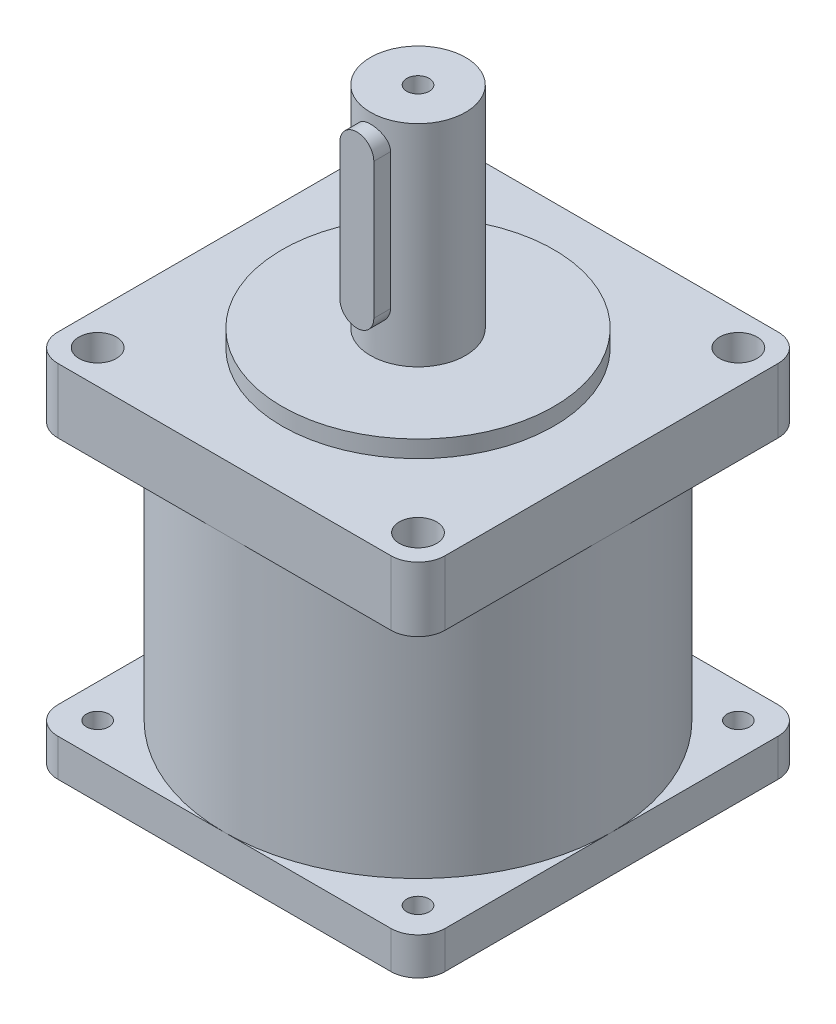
ISO-10303-21;
HEADER;
FILE_DESCRIPTION(('STEP AP214'),'2;1');
FILE_NAME('part.step','',(''),(''),'','','');
FILE_SCHEMA(('AUTOMOTIVE_DESIGN { 1 0 10303 214 1 1 1 1 }'));
ENDSEC;
DATA;
#1=APPLICATION_CONTEXT('core data for automotive mechanical design processes');
#2=APPLICATION_PROTOCOL_DEFINITION('international standard','automotive_design',2000,#1);
#3=PRODUCT_CONTEXT('',#1,'mechanical');
#4=PRODUCT('Part','Part','',(#3));
#5=PRODUCT_RELATED_PRODUCT_CATEGORY('part','',(#4));
#6=PRODUCT_DEFINITION_FORMATION('','',#4);
#7=PRODUCT_DEFINITION_CONTEXT('part definition',#1,'design');
#8=PRODUCT_DEFINITION('design','',#6,#7);
#9=PRODUCT_DEFINITION_SHAPE('','',#8);
#10=(LENGTH_UNIT() NAMED_UNIT(*) SI_UNIT(.MILLI.,.METRE.));
#11=(NAMED_UNIT(*) PLANE_ANGLE_UNIT() SI_UNIT($,.RADIAN.));
#12=(NAMED_UNIT(*) SI_UNIT($,.STERADIAN.) SOLID_ANGLE_UNIT());
#13=UNCERTAINTY_MEASURE_WITH_UNIT(LENGTH_MEASURE(1.E-05),#10,'distance_accuracy_value','');
#14=(GEOMETRIC_REPRESENTATION_CONTEXT(3) GLOBAL_UNCERTAINTY_ASSIGNED_CONTEXT((#13)) GLOBAL_UNIT_ASSIGNED_CONTEXT((#10,
#11,#12)) REPRESENTATION_CONTEXT('',''));
#15=CARTESIAN_POINT('',(0.,0.,0.));
#16=DIRECTION('',(0.,0.,1.));
#17=DIRECTION('',(1.,0.,0.));
#18=AXIS2_PLACEMENT_3D('',#15,#16,#17);
#19=CARTESIAN_POINT('',(0.,0.,0.));
#20=DIRECTION('',(0.,1.,0.));
#21=DIRECTION('',(0.,0.,1.));
#22=AXIS2_PLACEMENT_3D('',#19,#20,#21);
#23=PLANE('',#22);
#24=CARTESIAN_POINT('',(23.57,0.,23.57));
#25=DIRECTION('',(0.,1.,0.));
#26=DIRECTION('',(0.,0.,1.));
#27=AXIS2_PLACEMENT_3D('',#24,#25,#26);
#28=CIRCLE('',#27,2.75);
#29=CARTESIAN_POINT('',(23.57,0.,26.32));
#30=VERTEX_POINT('',#29);
#31=EDGE_CURVE('E599',#30,#30,#28,.T.);
#32=ORIENTED_EDGE('',*,*,#31,.T.);
#33=EDGE_LOOP('',(#32));
#34=FACE_BOUND('',#33,.T.);
#35=DIRECTION('',(0.,0.,-1.));
#36=VECTOR('',#35,1.);
#37=CARTESIAN_POINT('',(28.5,0.,-28.5));
#38=LINE('',#37,#36);
#39=CARTESIAN_POINT('',(28.5,0.,24.5));
#40=VERTEX_POINT('',#39);
#41=CARTESIAN_POINT('',(28.5,0.,0.));
#42=VERTEX_POINT('',#41);
#43=EDGE_CURVE('E575',#40,#42,#38,.T.);
#44=ORIENTED_EDGE('',*,*,#43,.F.);
#45=CARTESIAN_POINT('',(24.5,0.,24.5));
#46=DIRECTION('',(0.,1.,0.));
#47=DIRECTION('',(0.,0.,1.));
#48=AXIS2_PLACEMENT_3D('',#45,#46,#47);
#49=CIRCLE('',#48,4.);
#50=CARTESIAN_POINT('',(24.5,0.,28.5));
#51=VERTEX_POINT('',#50);
#52=EDGE_CURVE('E58',#40,#51,#49,.F.);
#53=ORIENTED_EDGE('',*,*,#52,.T.);
#54=DIRECTION('',(1.,0.,0.));
#55=VECTOR('',#54,1.);
#56=CARTESIAN_POINT('',(-28.5,0.,28.5));
#57=LINE('',#56,#55);
#58=CARTESIAN_POINT('',(0.,0.,28.5));
#59=VERTEX_POINT('',#58);
#60=EDGE_CURVE('E369',#59,#51,#57,.T.);
#61=ORIENTED_EDGE('',*,*,#60,.F.);
#62=CARTESIAN_POINT('',(0.,0.,0.));
#63=DIRECTION('',(0.,1.,0.));
#64=DIRECTION('',(0.,0.,1.));
#65=AXIS2_PLACEMENT_3D('',#62,#63,#64);
#66=CIRCLE('',#65,28.5);
#67=EDGE_CURVE('E243',#59,#42,#66,.T.);
#68=ORIENTED_EDGE('',*,*,#67,.T.);
#69=EDGE_LOOP('',(#44,#53,#61,#68));
#70=FACE_BOUND('',#69,.T.);
#71=ADVANCED_FACE('F36',(#34,#70),#23,.F.);
#72=CARTESIAN_POINT('',(23.57,0.,-23.57));
#73=DIRECTION('',(0.,1.,0.));
#74=DIRECTION('',(0.,0.,1.));
#75=AXIS2_PLACEMENT_3D('',#72,#73,#74);
#76=CIRCLE('',#75,2.75);
#77=CARTESIAN_POINT('',(23.57,0.,-20.82));
#78=VERTEX_POINT('',#77);
#79=EDGE_CURVE('E604',#78,#78,#76,.T.);
#80=ORIENTED_EDGE('',*,*,#79,.T.);
#81=EDGE_LOOP('',(#80));
#82=FACE_BOUND('',#81,.T.);
#83=DIRECTION('',(-1.,0.,0.));
#84=VECTOR('',#83,1.);
#85=CARTESIAN_POINT('',(-28.5,0.,-28.5));
#86=LINE('',#85,#84);
#87=CARTESIAN_POINT('',(24.5,0.,-28.5));
#88=VERTEX_POINT('',#87);
#89=CARTESIAN_POINT('',(0.,0.,-28.5));
#90=VERTEX_POINT('',#89);
#91=EDGE_CURVE('E374',#88,#90,#86,.T.);
#92=ORIENTED_EDGE('',*,*,#91,.F.);
#93=CARTESIAN_POINT('',(24.5,0.,-24.5));
#94=DIRECTION('',(0.,1.,0.));
#95=DIRECTION('',(0.,0.,1.));
#96=AXIS2_PLACEMENT_3D('',#93,#94,#95);
#97=CIRCLE('',#96,4.);
#98=CARTESIAN_POINT('',(28.5,0.,-24.5));
#99=VERTEX_POINT('',#98);
#100=EDGE_CURVE('E545',#88,#99,#97,.F.);
#101=ORIENTED_EDGE('',*,*,#100,.T.);
#102=EDGE_CURVE('E578',#42,#99,#38,.T.);
#103=ORIENTED_EDGE('',*,*,#102,.F.);
#104=EDGE_CURVE('E246',#42,#90,#66,.T.);
#105=ORIENTED_EDGE('',*,*,#104,.T.);
#106=EDGE_LOOP('',(#92,#101,#103,#105));
#107=FACE_BOUND('',#106,.T.);
#108=ADVANCED_FACE('F329',(#82,#107),#23,.F.);
#109=CARTESIAN_POINT('',(-23.57,0.,-23.57));
#110=DIRECTION('',(0.,1.,0.));
#111=DIRECTION('',(0.,0.,1.));
#112=AXIS2_PLACEMENT_3D('',#109,#110,#111);
#113=CIRCLE('',#112,2.75);
#114=CARTESIAN_POINT('',(-23.57,0.,-20.82));
#115=VERTEX_POINT('',#114);
#116=EDGE_CURVE('E359',#115,#115,#113,.T.);
#117=ORIENTED_EDGE('',*,*,#116,.T.);
#118=EDGE_LOOP('',(#117));
#119=FACE_BOUND('',#118,.T.);
#120=DIRECTION('',(0.,0.,1.));
#121=VECTOR('',#120,1.);
#122=CARTESIAN_POINT('',(-28.5,0.,-28.5));
#123=LINE('',#122,#121);
#124=CARTESIAN_POINT('',(-28.5,0.,-24.5));
#125=VERTEX_POINT('',#124);
#126=CARTESIAN_POINT('',(-28.5,0.,0.));
#127=VERTEX_POINT('',#126);
#128=EDGE_CURVE('E361',#125,#127,#123,.T.);
#129=ORIENTED_EDGE('',*,*,#128,.F.);
#130=CARTESIAN_POINT('',(-24.5,0.,-24.5));
#131=DIRECTION('',(0.,1.,0.));
#132=DIRECTION('',(0.,0.,1.));
#133=AXIS2_PLACEMENT_3D('',#130,#131,#132);
#134=CIRCLE('',#133,4.);
#135=CARTESIAN_POINT('',(-24.5,0.,-28.5));
#136=VERTEX_POINT('',#135);
#137=EDGE_CURVE('E363',#125,#136,#134,.F.);
#138=ORIENTED_EDGE('',*,*,#137,.T.);
#139=EDGE_CURVE('E577',#90,#136,#86,.T.);
#140=ORIENTED_EDGE('',*,*,#139,.F.);
#141=EDGE_CURVE('E255',#90,#127,#66,.T.);
#142=ORIENTED_EDGE('',*,*,#141,.T.);
#143=EDGE_LOOP('',(#129,#138,#140,#142));
#144=FACE_BOUND('',#143,.T.);
#145=ADVANCED_FACE('F335',(#119,#144),#23,.F.);
#146=CARTESIAN_POINT('',(0.,43.,0.));
#147=DIRECTION('',(0.,-1.,0.));
#148=DIRECTION('',(0.,0.,-1.));
#149=AXIS2_PLACEMENT_3D('',#146,#147,#148);
#150=CYLINDRICAL_SURFACE('',#149,7.);
#151=CARTESIAN_POINT('',(0.,43.,0.));
#152=DIRECTION('',(0.,1.,0.));
#153=DIRECTION('',(0.,0.,1.));
#154=AXIS2_PLACEMENT_3D('',#151,#152,#153);
#155=CIRCLE('',#154,7.);
#156=CARTESIAN_POINT('',(0.,43.,7.));
#157=VERTEX_POINT('',#156);
#158=EDGE_CURVE('E383',#157,#157,#155,.T.);
#159=ORIENTED_EDGE('',*,*,#158,.F.);
#160=EDGE_LOOP('',(#159));
#161=FACE_BOUND('',#160,.T.);
#162=CARTESIAN_POINT('',(0.,12.,0.));
#163=DIRECTION('',(0.,1.,0.));
#164=DIRECTION('',(0.,0.,1.));
#165=AXIS2_PLACEMENT_3D('',#162,#163,#164);
#166=CIRCLE('',#165,7.);
#167=CARTESIAN_POINT('',(0.,12.,7.));
#168=VERTEX_POINT('',#167);
#169=EDGE_CURVE('E379',#168,#168,#166,.F.);
#170=ORIENTED_EDGE('',*,*,#169,.F.);
#171=EDGE_LOOP('',(#170));
#172=FACE_BOUND('',#171,.T.);
#173=CARTESIAN_POINT('',(-2.5,39.,6.53834841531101));
#174=CARTESIAN_POINT('',(-2.50000293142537,38.8644729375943,6.53834584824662));
#175=CARTESIAN_POINT('',(-2.48894249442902,38.7289661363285,6.54260813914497));
#176=CARTESIAN_POINT('',(-2.44517096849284,38.4620070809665,6.55909115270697));
#177=CARTESIAN_POINT('',(-2.41245881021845,38.3305550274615,6.57131226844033));
#178=CARTESIAN_POINT('',(-2.32671186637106,38.0756252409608,6.60215581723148));
#179=CARTESIAN_POINT('',(-2.27372177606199,37.9521306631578,6.62076416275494));
#180=CARTESIAN_POINT('',(-2.14907922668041,37.7157391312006,6.66226377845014));
#181=CARTESIAN_POINT('',(-2.0774217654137,37.6028450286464,6.68515619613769));
#182=CARTESIAN_POINT('',(-1.91402447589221,37.3857788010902,6.73379932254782));
#183=CARTESIAN_POINT('',(-1.82158324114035,37.2821521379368,6.75962863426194));
#184=CARTESIAN_POINT('',(-1.62073451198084,37.0914931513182,6.81057580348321));
#185=CARTESIAN_POINT('',(-1.51232401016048,37.004463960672,6.8356935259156));
#186=CARTESIAN_POINT('',(-1.27854087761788,36.8469109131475,6.88331097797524));
#187=CARTESIAN_POINT('',(-1.15275218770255,36.7769705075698,6.90570766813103));
#188=CARTESIAN_POINT('',(-0.890255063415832,36.6594649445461,6.94442306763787));
#189=CARTESIAN_POINT('',(-0.753550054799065,36.6118927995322,6.9607436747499));
#190=CARTESIAN_POINT('',(-0.478828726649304,36.5423590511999,6.98491061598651));
#191=CARTESIAN_POINT('',(-0.34107728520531,36.5194604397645,6.99306609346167));
#192=CARTESIAN_POINT('',(-0.0634617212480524,36.4969316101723,7.00108797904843));
#193=CARTESIAN_POINT('',(0.0764017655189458,36.4972945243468,7.0009568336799));
#194=CARTESIAN_POINT('',(0.347592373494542,36.5207111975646,6.99262260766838));
#195=CARTESIAN_POINT('',(0.479020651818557,36.5427445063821,6.98478254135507));
#196=CARTESIAN_POINT('',(0.736174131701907,36.6071728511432,6.96237851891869));
#197=CARTESIAN_POINT('',(0.861898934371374,36.6495693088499,6.94781409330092));
#198=CARTESIAN_POINT('',(1.10616096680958,36.7540469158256,6.91316507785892));
#199=CARTESIAN_POINT('',(1.22457268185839,36.8163957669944,6.89300594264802));
#200=CARTESIAN_POINT('',(1.44953519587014,36.9587791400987,6.84923357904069));
#201=CARTESIAN_POINT('',(1.55608236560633,37.0388190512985,6.82561929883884));
#202=CARTESIAN_POINT('',(1.76033248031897,37.2193307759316,6.77590353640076));
#203=CARTESIAN_POINT('',(1.85725678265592,37.3206669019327,6.74973657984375));
#204=CARTESIAN_POINT('',(2.03301110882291,37.5383434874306,6.69889962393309));
#205=CARTESIAN_POINT('',(2.11183741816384,37.6546870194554,6.67422993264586));
#206=CARTESIAN_POINT('',(2.25045901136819,37.9018776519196,6.62879124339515));
#207=CARTESIAN_POINT('',(2.30987563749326,38.0329530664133,6.6081027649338));
#208=CARTESIAN_POINT('',(2.40551106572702,38.304179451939,6.57389739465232));
#209=CARTESIAN_POINT('',(2.44174134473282,38.4443258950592,6.56037695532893));
#210=CARTESIAN_POINT('',(2.48828716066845,38.7220838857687,6.54286005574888));
#211=CARTESIAN_POINT('',(2.49982704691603,38.859461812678,6.53841416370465));
#212=CARTESIAN_POINT('',(2.50016897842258,39.1342333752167,6.53828418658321));
#213=CARTESIAN_POINT('',(2.48897597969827,39.2716270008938,6.54259819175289));
#214=CARTESIAN_POINT('',(2.44527599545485,39.5365737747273,6.55904904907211));
#215=CARTESIAN_POINT('',(2.41367185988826,39.6642987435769,6.57085417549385));
#216=CARTESIAN_POINT('',(2.33115923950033,39.9125899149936,6.60057618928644));
#217=CARTESIAN_POINT('',(2.2802470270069,40.0331547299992,6.6184942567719));
#218=CARTESIAN_POINT('',(2.15854403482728,40.2684001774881,6.65919897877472));
#219=CARTESIAN_POINT('',(2.08711845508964,40.3827259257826,6.68213439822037));
#220=CARTESIAN_POINT('',(1.92711056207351,40.598207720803,6.73002297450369));
#221=CARTESIAN_POINT('',(1.83852249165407,40.6993593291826,6.75497680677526));
#222=CARTESIAN_POINT('',(1.64077043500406,40.8915426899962,6.80579566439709));
#223=CARTESIAN_POINT('',(1.53072651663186,40.9816793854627,6.83163247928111));
#224=CARTESIAN_POINT('',(1.29643714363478,41.1422926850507,6.87993729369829));
#225=CARTESIAN_POINT('',(1.1721919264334,41.2127696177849,6.90240534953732));
#226=CARTESIAN_POINT('',(0.91338047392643,41.3315002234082,6.94137984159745));
#227=CARTESIAN_POINT('',(0.778870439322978,41.3798660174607,6.95791626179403));
#228=CARTESIAN_POINT('',(0.502906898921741,41.4530468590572,6.9832833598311));
#229=CARTESIAN_POINT('',(0.361456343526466,41.4778718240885,6.99211728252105));
#230=CARTESIAN_POINT('',(0.0837575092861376,41.5022729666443,7.0008038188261));
#231=CARTESIAN_POINT('',(-0.0523654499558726,41.5031261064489,7.00111065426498));
#232=CARTESIAN_POINT('',(-0.322726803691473,41.4827846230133,6.99386365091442));
#233=CARTESIAN_POINT('',(-0.456965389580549,41.4615922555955,6.98631061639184));
#234=CARTESIAN_POINT('',(-0.716981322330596,41.3986398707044,6.96438311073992));
#235=CARTESIAN_POINT('',(-0.842875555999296,41.3573092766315,6.95015128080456));
#236=CARTESIAN_POINT('',(-1.08597143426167,41.2556669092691,6.91633887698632));
#237=CARTESIAN_POINT('',(-1.20317144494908,41.1953515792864,6.8967573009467));
#238=CARTESIAN_POINT('',(-1.43068233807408,41.0546886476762,6.85325490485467));
#239=CARTESIAN_POINT('',(-1.54052934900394,40.9736355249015,6.82919171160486));
#240=CARTESIAN_POINT('',(-1.74546847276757,40.7949475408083,6.77971046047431));
#241=CARTESIAN_POINT('',(-1.84055552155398,40.6973070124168,6.75429194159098));
#242=CARTESIAN_POINT('',(-2.01782220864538,40.4827811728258,6.70352883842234));
#243=CARTESIAN_POINT('',(-2.09919180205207,40.3652101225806,6.67824313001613));
#244=CARTESIAN_POINT('',(-2.24100798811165,40.1172615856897,6.63200351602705));
#245=CARTESIAN_POINT('',(-2.30145599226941,39.9868849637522,6.61104931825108));
#246=CARTESIAN_POINT('',(-2.39953333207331,39.7162590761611,6.57609213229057));
#247=CARTESIAN_POINT('',(-2.43706721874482,39.5759711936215,6.56211826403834));
#248=CARTESIAN_POINT('',(-2.48729274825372,39.2904461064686,6.54325005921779));
#249=CARTESIAN_POINT('',(-2.4999968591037,39.1452114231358,6.53835116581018));
#250=CARTESIAN_POINT('',(-2.5,39.,6.53834841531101));
#251=B_SPLINE_CURVE_WITH_KNOTS('',3,(#173,#174,#175,#176,#177,#178,#179,#180,#181,#182,#183,
#184,#185,#186,#187,#188,#189,#190,#191,#192,#193,#194,#195,#196,#197,#198,#199,#200,#201,#202,
#203,#204,#205,#206,#207,#208,#209,#210,#211,#212,#213,#214,#215,#216,#217,#218,#219,#220,#221,
#222,#223,#224,#225,#226,#227,#228,#229,#230,#231,#232,#233,#234,#235,#236,#237,#238,#239,#240,
#241,#242,#243,#244,#245,#246,#247,#248,#249,#250),.UNSPECIFIED.,.T.,.F.,(4,2,2,2,2,2,2,2,2,2,2,
2,2,2,2,2,2,2,2,2,2,2,2,2,2,2,2,2,2,2,2,2,2,2,2,2,2,2,4),(0.,0.406041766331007,
0.812103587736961,1.21727550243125,1.62255610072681,2.04441002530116,2.46634349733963,
2.90112813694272,3.33577686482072,3.75326460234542,4.17062908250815,4.56923737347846,
4.96787349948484,5.37209971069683,5.77644923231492,6.20244167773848,6.62852147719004,
7.06247609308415,7.4962157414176,7.90789453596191,8.31948358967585,8.71400941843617,
9.10861145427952,9.5170588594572,9.92564351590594,10.3573204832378,10.7889902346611,
11.2184461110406,11.6477209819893,12.0540827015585,12.4604028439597,12.8584146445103,
13.2565010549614,13.67053016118,14.0847010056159,14.5182116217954,14.9516929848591,
15.386967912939,15.8220242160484),.UNSPECIFIED.);
#252=CARTESIAN_POINT('',(2.5,39.,6.53834841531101));
#253=VERTEX_POINT('',#252);
#254=CARTESIAN_POINT('',(-2.5,39.,6.53834841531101));
#255=VERTEX_POINT('',#254);
#256=EDGE_CURVE('E257',#253,#255,#251,.T.);
#257=ORIENTED_EDGE('',*,*,#256,.F.);
#258=DIRECTION('',(0.,-1.,0.));
#259=VECTOR('',#258,1.);
#260=CARTESIAN_POINT('',(2.5,43.,6.53834841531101));
#261=LINE('',#260,#259);
#262=CARTESIAN_POINT('',(2.5,19.,6.53834841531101));
#263=VERTEX_POINT('',#262);
#264=EDGE_CURVE('E384',#263,#253,#261,.F.);
#265=ORIENTED_EDGE('',*,*,#264,.F.);
#266=CARTESIAN_POINT('',(-2.5,19.,6.53834841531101));
#267=CARTESIAN_POINT('',(-2.50000293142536,18.8644729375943,6.53834584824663));
#268=CARTESIAN_POINT('',(-2.48894249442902,18.7289661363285,6.54260813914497));
#269=CARTESIAN_POINT('',(-2.44517096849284,18.4620070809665,6.55909115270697));
#270=CARTESIAN_POINT('',(-2.41245881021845,18.3305550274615,6.57131226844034));
#271=CARTESIAN_POINT('',(-2.32671186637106,18.0756252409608,6.60215581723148));
#272=CARTESIAN_POINT('',(-2.27372177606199,17.9521306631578,6.62076416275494));
#273=CARTESIAN_POINT('',(-2.14907922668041,17.7157391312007,6.66226377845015));
#274=CARTESIAN_POINT('',(-2.0774217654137,17.6028450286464,6.68515619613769));
#275=CARTESIAN_POINT('',(-1.91402447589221,17.3857788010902,6.73379932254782));
#276=CARTESIAN_POINT('',(-1.82158324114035,17.2821521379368,6.75962863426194));
#277=CARTESIAN_POINT('',(-1.62073451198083,17.0914931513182,6.81057580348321));
#278=CARTESIAN_POINT('',(-1.51232401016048,17.004463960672,6.8356935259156));
#279=CARTESIAN_POINT('',(-1.27854087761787,16.8469109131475,6.88331097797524));
#280=CARTESIAN_POINT('',(-1.15275218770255,16.7769705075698,6.90570766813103));
#281=CARTESIAN_POINT('',(-0.890255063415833,16.6594649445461,6.94442306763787));
#282=CARTESIAN_POINT('',(-0.753550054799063,16.6118927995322,6.9607436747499));
#283=CARTESIAN_POINT('',(-0.478828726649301,16.5423590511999,6.98491061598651));
#284=CARTESIAN_POINT('',(-0.341077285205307,16.5194604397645,6.99306609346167));
#285=CARTESIAN_POINT('',(-0.0634617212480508,16.4969316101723,7.00108797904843));
#286=CARTESIAN_POINT('',(0.0764017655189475,16.4972945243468,7.0009568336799));
#287=CARTESIAN_POINT('',(0.347592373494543,16.5207111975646,6.99262260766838));
#288=CARTESIAN_POINT('',(0.479020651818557,16.5427445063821,6.98478254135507));
#289=CARTESIAN_POINT('',(0.736174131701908,16.6071728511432,6.96237851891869));
#290=CARTESIAN_POINT('',(0.861898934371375,16.6495693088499,6.94781409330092));
#291=CARTESIAN_POINT('',(1.10616096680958,16.7540469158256,6.91316507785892));
#292=CARTESIAN_POINT('',(1.22457268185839,16.8163957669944,6.89300594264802));
#293=CARTESIAN_POINT('',(1.44953519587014,16.9587791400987,6.84923357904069));
#294=CARTESIAN_POINT('',(1.55608236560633,17.0388190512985,6.82561929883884));
#295=CARTESIAN_POINT('',(1.76033248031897,17.2193307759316,6.77590353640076));
#296=CARTESIAN_POINT('',(1.85725678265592,17.3206669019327,6.74973657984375));
#297=CARTESIAN_POINT('',(2.03301110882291,17.5383434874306,6.69889962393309));
#298=CARTESIAN_POINT('',(2.11183741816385,17.6546870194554,6.67422993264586));
#299=CARTESIAN_POINT('',(2.25045901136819,17.9018776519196,6.62879124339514));
#300=CARTESIAN_POINT('',(2.30987563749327,18.0329530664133,6.6081027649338));
#301=CARTESIAN_POINT('',(2.40551106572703,18.304179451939,6.57389739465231));
#302=CARTESIAN_POINT('',(2.44174134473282,18.4443258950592,6.56037695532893));
#303=CARTESIAN_POINT('',(2.48828716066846,18.7220838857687,6.54286005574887));
#304=CARTESIAN_POINT('',(2.49982704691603,18.859461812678,6.53841416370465));
#305=CARTESIAN_POINT('',(2.50016897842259,19.1342333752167,6.53828418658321));
#306=CARTESIAN_POINT('',(2.48897597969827,19.2716270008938,6.54259819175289));
#307=CARTESIAN_POINT('',(2.44527599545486,19.5365737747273,6.55904904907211));
#308=CARTESIAN_POINT('',(2.41367185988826,19.6642987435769,6.57085417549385));
#309=CARTESIAN_POINT('',(2.33115923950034,19.9125899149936,6.60057618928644));
#310=CARTESIAN_POINT('',(2.2802470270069,20.0331547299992,6.6184942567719));
#311=CARTESIAN_POINT('',(2.15854403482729,20.2684001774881,6.65919897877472));
#312=CARTESIAN_POINT('',(2.08711845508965,20.3827259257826,6.68213439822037));
#313=CARTESIAN_POINT('',(1.92711056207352,20.598207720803,6.73002297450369));
#314=CARTESIAN_POINT('',(1.83852249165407,20.6993593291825,6.75497680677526));
#315=CARTESIAN_POINT('',(1.64077043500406,20.8915426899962,6.80579566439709));
#316=CARTESIAN_POINT('',(1.53072651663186,20.9816793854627,6.83163247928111));
#317=CARTESIAN_POINT('',(1.29643714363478,21.1422926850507,6.87993729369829));
#318=CARTESIAN_POINT('',(1.17219192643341,21.2127696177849,6.90240534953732));
#319=CARTESIAN_POINT('',(0.913380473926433,21.3315002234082,6.94137984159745));
#320=CARTESIAN_POINT('',(0.778870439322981,21.3798660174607,6.95791626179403));
#321=CARTESIAN_POINT('',(0.502906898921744,21.4530468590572,6.9832833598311));
#322=CARTESIAN_POINT('',(0.361456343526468,21.4778718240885,6.99211728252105));
#323=CARTESIAN_POINT('',(0.0837575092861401,21.5022729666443,7.0008038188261));
#324=CARTESIAN_POINT('',(-0.0523654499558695,21.5031261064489,7.00111065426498));
#325=CARTESIAN_POINT('',(-0.322726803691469,21.4827846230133,6.99386365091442));
#326=CARTESIAN_POINT('',(-0.456965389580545,21.4615922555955,6.98631061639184));
#327=CARTESIAN_POINT('',(-0.716981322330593,21.3986398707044,6.96438311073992));
#328=CARTESIAN_POINT('',(-0.842875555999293,21.3573092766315,6.95015128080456));
#329=CARTESIAN_POINT('',(-1.08597143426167,21.2556669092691,6.91633887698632));
#330=CARTESIAN_POINT('',(-1.20317144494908,21.1953515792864,6.8967573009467));
#331=CARTESIAN_POINT('',(-1.43068233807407,21.0546886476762,6.85325490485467));
#332=CARTESIAN_POINT('',(-1.54052934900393,20.9736355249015,6.82919171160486));
#333=CARTESIAN_POINT('',(-1.74546847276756,20.7949475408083,6.77971046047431));
#334=CARTESIAN_POINT('',(-1.84055552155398,20.6973070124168,6.75429194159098));
#335=CARTESIAN_POINT('',(-2.01782220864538,20.4827811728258,6.70352883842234));
#336=CARTESIAN_POINT('',(-2.09919180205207,20.3652101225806,6.67824313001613));
#337=CARTESIAN_POINT('',(-2.24100798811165,20.1172615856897,6.63200351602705));
#338=CARTESIAN_POINT('',(-2.30145599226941,19.9868849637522,6.61104931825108));
#339=CARTESIAN_POINT('',(-2.39953333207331,19.7162590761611,6.57609213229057));
#340=CARTESIAN_POINT('',(-2.43706721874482,19.5759711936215,6.56211826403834));
#341=CARTESIAN_POINT('',(-2.48729274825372,19.2904461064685,6.54325005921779));
#342=CARTESIAN_POINT('',(-2.49999685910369,19.1452114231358,6.53835116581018));
#343=CARTESIAN_POINT('',(-2.5,19.,6.53834841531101));
#344=B_SPLINE_CURVE_WITH_KNOTS('',3,(#266,#267,#268,#269,#270,#271,#272,#273,#274,#275,#276,
#277,#278,#279,#280,#281,#282,#283,#284,#285,#286,#287,#288,#289,#290,#291,#292,#293,#294,#295,
#296,#297,#298,#299,#300,#301,#302,#303,#304,#305,#306,#307,#308,#309,#310,#311,#312,#313,#314,
#315,#316,#317,#318,#319,#320,#321,#322,#323,#324,#325,#326,#327,#328,#329,#330,#331,#332,#333,
#334,#335,#336,#337,#338,#339,#340,#341,#342,#343),.UNSPECIFIED.,.T.,.F.,(4,2,2,2,2,2,2,2,2,2,2,
2,2,2,2,2,2,2,2,2,2,2,2,2,2,2,2,2,2,2,2,2,2,2,2,2,2,2,4),(0.,0.406041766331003,
0.812103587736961,1.21727550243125,1.62255610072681,2.04441002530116,2.46634349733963,
2.90112813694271,3.33577686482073,3.75326460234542,4.17062908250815,4.56923737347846,
4.96787349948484,5.37209971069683,5.77644923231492,6.20244167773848,6.62852147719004,
7.06247609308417,7.4962157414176,7.90789453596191,8.31948358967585,8.71400941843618,
9.10861145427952,9.5170588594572,9.92564351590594,10.3573204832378,10.7889902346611,
11.2184461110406,11.6477209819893,12.0540827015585,12.4604028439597,12.8584146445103,
13.2565010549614,13.67053016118,14.0847010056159,14.5182116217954,14.9516929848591,
15.386967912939,15.8220242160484),.UNSPECIFIED.);
#345=CARTESIAN_POINT('',(-2.5,19.,6.53834841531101));
#346=VERTEX_POINT('',#345);
#347=EDGE_CURVE('E271',#346,#263,#344,.T.);
#348=ORIENTED_EDGE('',*,*,#347,.F.);
#349=DIRECTION('',(0.,-1.,0.));
#350=VECTOR('',#349,1.);
#351=CARTESIAN_POINT('',(-2.5,43.,6.53834841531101));
#352=LINE('',#351,#350);
#353=EDGE_CURVE('E264',#255,#346,#352,.T.);
#354=ORIENTED_EDGE('',*,*,#353,.F.);
#355=EDGE_LOOP('',(#257,#265,#348,#354));
#356=FACE_BOUND('',#355,.T.);
#357=ADVANCED_FACE('F282',(#161,#172,#356),#150,.T.);
#358=CARTESIAN_POINT('',(0.,12.,0.));
#359=DIRECTION('',(0.,1.,0.));
#360=DIRECTION('',(0.,0.,1.));
#361=AXIS2_PLACEMENT_3D('',#358,#359,#360);
#362=PLANE('',#361);
#363=CARTESIAN_POINT('',(0.,12.,0.));
#364=DIRECTION('',(0.,1.,0.));
#365=DIRECTION('',(0.,0.,1.));
#366=AXIS2_PLACEMENT_3D('',#363,#364,#365);
#367=CIRCLE('',#366,20.);
#368=CARTESIAN_POINT('',(0.,12.,20.));
#369=VERTEX_POINT('',#368);
#370=EDGE_CURVE('E579',#369,#369,#367,.T.);
#371=ORIENTED_EDGE('',*,*,#370,.T.);
#372=EDGE_LOOP('',(#371));
#373=FACE_BOUND('',#372,.T.);
#374=ORIENTED_EDGE('',*,*,#169,.T.);
#375=EDGE_LOOP('',(#374));
#376=FACE_BOUND('',#375,.T.);
#377=ADVANCED_FACE('F354',(#373,#376),#362,.T.);
#378=CARTESIAN_POINT('',(0.,9.5,0.));
#379=DIRECTION('',(0.,1.,0.));
#380=DIRECTION('',(0.,0.,1.));
#381=AXIS2_PLACEMENT_3D('',#378,#379,#380);
#382=PLANE('',#381);
#383=CARTESIAN_POINT('',(23.57,9.5,-23.57));
#384=DIRECTION('',(0.,1.,0.));
#385=DIRECTION('',(0.,0.,1.));
#386=AXIS2_PLACEMENT_3D('',#383,#384,#385);
#387=CIRCLE('',#386,2.75);
#388=CARTESIAN_POINT('',(23.57,9.5,-20.82));
#389=VERTEX_POINT('',#388);
#390=EDGE_CURVE('E606',#389,#389,#387,.T.);
#391=ORIENTED_EDGE('',*,*,#390,.F.);
#392=EDGE_LOOP('',(#391));
#393=FACE_BOUND('',#392,.T.);
#394=CARTESIAN_POINT('',(23.57,9.5,23.57));
#395=DIRECTION('',(0.,1.,0.));
#396=DIRECTION('',(0.,0.,1.));
#397=AXIS2_PLACEMENT_3D('',#394,#395,#396);
#398=CIRCLE('',#397,2.75);
#399=CARTESIAN_POINT('',(23.57,9.5,26.32));
#400=VERTEX_POINT('',#399);
#401=EDGE_CURVE('E601',#400,#400,#398,.T.);
#402=ORIENTED_EDGE('',*,*,#401,.F.);
#403=EDGE_LOOP('',(#402));
#404=FACE_BOUND('',#403,.T.);
#405=CARTESIAN_POINT('',(-23.57,9.5,23.57));
#406=DIRECTION('',(0.,1.,0.));
#407=DIRECTION('',(0.,0.,1.));
#408=AXIS2_PLACEMENT_3D('',#405,#406,#407);
#409=CIRCLE('',#408,2.75);
#410=CARTESIAN_POINT('',(-23.57,9.5,26.32));
#411=VERTEX_POINT('',#410);
#412=EDGE_CURVE('E596',#411,#411,#409,.T.);
#413=ORIENTED_EDGE('',*,*,#412,.F.);
#414=EDGE_LOOP('',(#413));
#415=FACE_BOUND('',#414,.T.);
#416=CARTESIAN_POINT('',(-23.57,9.5,-23.57));
#417=DIRECTION('',(0.,1.,0.));
#418=DIRECTION('',(0.,0.,1.));
#419=AXIS2_PLACEMENT_3D('',#416,#417,#418);
#420=CIRCLE('',#419,2.75);
#421=CARTESIAN_POINT('',(-23.57,9.5,-20.82));
#422=VERTEX_POINT('',#421);
#423=EDGE_CURVE('E591',#422,#422,#420,.T.);
#424=ORIENTED_EDGE('',*,*,#423,.F.);
#425=EDGE_LOOP('',(#424));
#426=FACE_BOUND('',#425,.T.);
#427=DIRECTION('',(-1.,0.,0.));
#428=VECTOR('',#427,1.);
#429=CARTESIAN_POINT('',(-28.5,9.5,-28.5));
#430=LINE('',#429,#428);
#431=CARTESIAN_POINT('',(24.5,9.5,-28.5));
#432=VERTEX_POINT('',#431);
#433=CARTESIAN_POINT('',(-24.5,9.5,-28.5));
#434=VERTEX_POINT('',#433);
#435=EDGE_CURVE('E582',#432,#434,#430,.T.);
#436=ORIENTED_EDGE('',*,*,#435,.T.);
#437=CARTESIAN_POINT('',(-24.5,9.5,-24.5));
#438=DIRECTION('',(0.,1.,0.));
#439=DIRECTION('',(0.,0.,1.));
#440=AXIS2_PLACEMENT_3D('',#437,#438,#439);
#441=CIRCLE('',#440,4.);
#442=CARTESIAN_POINT('',(-28.5,9.5,-24.5));
#443=VERTEX_POINT('',#442);
#444=EDGE_CURVE('E543',#434,#443,#441,.T.);
#445=ORIENTED_EDGE('',*,*,#444,.T.);
#446=DIRECTION('',(0.,0.,1.));
#447=VECTOR('',#446,1.);
#448=CARTESIAN_POINT('',(-28.5,9.5,-28.5));
#449=LINE('',#448,#447);
#450=CARTESIAN_POINT('',(-28.5,9.5,24.5));
#451=VERTEX_POINT('',#450);
#452=EDGE_CURVE('E568',#443,#451,#449,.T.);
#453=ORIENTED_EDGE('',*,*,#452,.T.);
#454=CARTESIAN_POINT('',(-24.5,9.5,24.5));
#455=DIRECTION('',(0.,1.,0.));
#456=DIRECTION('',(0.,0.,1.));
#457=AXIS2_PLACEMENT_3D('',#454,#455,#456);
#458=CIRCLE('',#457,4.);
#459=CARTESIAN_POINT('',(-24.5,9.5,28.5));
#460=VERTEX_POINT('',#459);
#461=EDGE_CURVE('E537',#451,#460,#458,.T.);
#462=ORIENTED_EDGE('',*,*,#461,.T.);
#463=DIRECTION('',(1.,0.,0.));
#464=VECTOR('',#463,1.);
#465=CARTESIAN_POINT('',(-28.5,9.5,28.5));
#466=LINE('',#465,#464);
#467=CARTESIAN_POINT('',(24.5,9.5,28.5));
#468=VERTEX_POINT('',#467);
#469=EDGE_CURVE('E386',#460,#468,#466,.T.);
#470=ORIENTED_EDGE('',*,*,#469,.T.);
#471=CARTESIAN_POINT('',(24.5,9.5,24.5));
#472=DIRECTION('',(0.,1.,0.));
#473=DIRECTION('',(0.,0.,1.));
#474=AXIS2_PLACEMENT_3D('',#471,#472,#473);
#475=CIRCLE('',#474,4.);
#476=CARTESIAN_POINT('',(28.5,9.5,24.5));
#477=VERTEX_POINT('',#476);
#478=EDGE_CURVE('E539',#468,#477,#475,.T.);
#479=ORIENTED_EDGE('',*,*,#478,.T.);
#480=DIRECTION('',(0.,0.,-1.));
#481=VECTOR('',#480,1.);
#482=CARTESIAN_POINT('',(28.5,9.5,-28.5));
#483=LINE('',#482,#481);
#484=CARTESIAN_POINT('',(28.5,9.5,-24.5));
#485=VERTEX_POINT('',#484);
#486=EDGE_CURVE('E378',#477,#485,#483,.T.);
#487=ORIENTED_EDGE('',*,*,#486,.T.);
#488=CARTESIAN_POINT('',(24.5,9.5,-24.5));
#489=DIRECTION('',(0.,1.,0.));
#490=DIRECTION('',(0.,0.,1.));
#491=AXIS2_PLACEMENT_3D('',#488,#489,#490);
#492=CIRCLE('',#491,4.);
#493=EDGE_CURVE('E541',#485,#432,#492,.T.);
#494=ORIENTED_EDGE('',*,*,#493,.T.);
#495=EDGE_LOOP('',(#436,#445,#453,#462,#470,#479,#487,#494));
#496=FACE_BOUND('',#495,.T.);
#497=CARTESIAN_POINT('',(0.,9.5,0.));
#498=DIRECTION('',(0.,1.,0.));
#499=DIRECTION('',(0.,0.,1.));
#500=AXIS2_PLACEMENT_3D('',#497,#498,#499);
#501=CIRCLE('',#500,20.);
#502=CARTESIAN_POINT('',(0.,9.5,20.));
#503=VERTEX_POINT('',#502);
#504=EDGE_CURVE('E382',#503,#503,#501,.T.);
#505=ORIENTED_EDGE('',*,*,#504,.F.);
#506=EDGE_LOOP('',(#505));
#507=FACE_BOUND('',#506,.T.);
#508=ADVANCED_FACE('F562',(#393,#404,#415,#426,#496,#507),#382,.T.);
#509=CARTESIAN_POINT('',(28.5,9.5,-28.5));
#510=DIRECTION('',(-1.,0.,0.));
#511=DIRECTION('',(0.,0.,1.));
#512=AXIS2_PLACEMENT_3D('',#509,#510,#511);
#513=PLANE('',#512);
#514=ORIENTED_EDGE('',*,*,#102,.T.);
#515=DIRECTION('',(0.,-1.,0.));
#516=VECTOR('',#515,1.);
#517=CARTESIAN_POINT('',(28.5,9.5,-24.5));
#518=LINE('',#517,#516);
#519=EDGE_CURVE('E550',#99,#485,#518,.F.);
#520=ORIENTED_EDGE('',*,*,#519,.T.);
#521=ORIENTED_EDGE('',*,*,#486,.F.);
#522=DIRECTION('',(0.,-1.,0.));
#523=VECTOR('',#522,1.);
#524=CARTESIAN_POINT('',(28.5,9.5,24.5));
#525=LINE('',#524,#523);
#526=EDGE_CURVE('E547',#477,#40,#525,.T.);
#527=ORIENTED_EDGE('',*,*,#526,.T.);
#528=ORIENTED_EDGE('',*,*,#43,.T.);
#529=EDGE_LOOP('',(#514,#520,#521,#527,#528));
#530=FACE_BOUND('',#529,.T.);
#531=ADVANCED_FACE('F574',(#530),#513,.F.);
#532=CARTESIAN_POINT('',(-28.5,9.5,-28.5));
#533=DIRECTION('',(0.,0.,1.));
#534=DIRECTION('',(1.,0.,0.));
#535=AXIS2_PLACEMENT_3D('',#532,#533,#534);
#536=PLANE('',#535);
#537=ORIENTED_EDGE('',*,*,#139,.T.);
#538=DIRECTION('',(0.,-1.,0.));
#539=VECTOR('',#538,1.);
#540=CARTESIAN_POINT('',(-24.5,9.5,-28.5));
#541=LINE('',#540,#539);
#542=EDGE_CURVE('E535',#136,#434,#541,.F.);
#543=ORIENTED_EDGE('',*,*,#542,.T.);
#544=ORIENTED_EDGE('',*,*,#435,.F.);
#545=DIRECTION('',(0.,-1.,0.));
#546=VECTOR('',#545,1.);
#547=CARTESIAN_POINT('',(24.5,9.5,-28.5));
#548=LINE('',#547,#546);
#549=EDGE_CURVE('E532',#432,#88,#548,.T.);
#550=ORIENTED_EDGE('',*,*,#549,.T.);
#551=ORIENTED_EDGE('',*,*,#91,.T.);
#552=EDGE_LOOP('',(#537,#543,#544,#550,#551));
#553=FACE_BOUND('',#552,.T.);
#554=ADVANCED_FACE('F949',(#553),#536,.F.);
#555=CARTESIAN_POINT('',(-28.5,9.5,-28.5));
#556=DIRECTION('',(1.,0.,0.));
#557=DIRECTION('',(0.,0.,-1.));
#558=AXIS2_PLACEMENT_3D('',#555,#556,#557);
#559=PLANE('',#558);
#560=ORIENTED_EDGE('',*,*,#452,.F.);
#561=DIRECTION('',(0.,-1.,0.));
#562=VECTOR('',#561,1.);
#563=CARTESIAN_POINT('',(-28.5,9.5,-24.5));
#564=LINE('',#563,#562);
#565=EDGE_CURVE('E529',#443,#125,#564,.T.);
#566=ORIENTED_EDGE('',*,*,#565,.T.);
#567=ORIENTED_EDGE('',*,*,#128,.T.);
#568=CARTESIAN_POINT('',(-28.5,0.,24.5));
#569=VERTEX_POINT('',#568);
#570=EDGE_CURVE('E370',#127,#569,#123,.T.);
#571=ORIENTED_EDGE('',*,*,#570,.T.);
#572=DIRECTION('',(0.,-1.,0.));
#573=VECTOR('',#572,1.);
#574=CARTESIAN_POINT('',(-28.5,9.5,24.5));
#575=LINE('',#574,#573);
#576=EDGE_CURVE('E523',#569,#451,#575,.F.);
#577=ORIENTED_EDGE('',*,*,#576,.T.);
#578=EDGE_LOOP('',(#560,#566,#567,#571,#577));
#579=FACE_BOUND('',#578,.T.);
#580=ADVANCED_FACE('F346',(#579),#559,.F.);
#581=CARTESIAN_POINT('',(-28.5,9.5,28.5));
#582=DIRECTION('',(0.,0.,-1.));
#583=DIRECTION('',(-1.,0.,0.));
#584=AXIS2_PLACEMENT_3D('',#581,#582,#583);
#585=PLANE('',#584);
#586=ORIENTED_EDGE('',*,*,#60,.T.);
#587=DIRECTION('',(0.,-1.,0.));
#588=VECTOR('',#587,1.);
#589=CARTESIAN_POINT('',(24.5,9.5,28.5));
#590=LINE('',#589,#588);
#591=EDGE_CURVE('E45',#51,#468,#590,.F.);
#592=ORIENTED_EDGE('',*,*,#591,.T.);
#593=ORIENTED_EDGE('',*,*,#469,.F.);
#594=DIRECTION('',(0.,-1.,0.));
#595=VECTOR('',#594,1.);
#596=CARTESIAN_POINT('',(-24.5,9.5,28.5));
#597=LINE('',#596,#595);
#598=CARTESIAN_POINT('',(-24.5,0.,28.5));
#599=VERTEX_POINT('',#598);
#600=EDGE_CURVE('E553',#460,#599,#597,.T.);
#601=ORIENTED_EDGE('',*,*,#600,.T.);
#602=EDGE_CURVE('E372',#599,#59,#57,.T.);
#603=ORIENTED_EDGE('',*,*,#602,.T.);
#604=EDGE_LOOP('',(#586,#592,#593,#601,#603));
#605=FACE_BOUND('',#604,.T.);
#606=ADVANCED_FACE('F341',(#605),#585,.F.);
#607=CARTESIAN_POINT('',(-23.57,0.,23.57));
#608=DIRECTION('',(0.,1.,0.));
#609=DIRECTION('',(0.,0.,1.));
#610=AXIS2_PLACEMENT_3D('',#607,#608,#609);
#611=CIRCLE('',#610,2.75);
#612=CARTESIAN_POINT('',(-23.57,0.,26.32));
#613=VERTEX_POINT('',#612);
#614=EDGE_CURVE('E594',#613,#613,#611,.T.);
#615=ORIENTED_EDGE('',*,*,#614,.T.);
#616=EDGE_LOOP('',(#615));
#617=FACE_BOUND('',#616,.T.);
#618=ORIENTED_EDGE('',*,*,#602,.F.);
#619=CARTESIAN_POINT('',(-24.5,0.,24.5));
#620=DIRECTION('',(0.,1.,0.));
#621=DIRECTION('',(0.,0.,1.));
#622=AXIS2_PLACEMENT_3D('',#619,#620,#621);
#623=CIRCLE('',#622,4.);
#624=EDGE_CURVE('E11',#599,#569,#623,.F.);
#625=ORIENTED_EDGE('',*,*,#624,.T.);
#626=ORIENTED_EDGE('',*,*,#570,.F.);
#627=EDGE_CURVE('E247',#127,#59,#66,.T.);
#628=ORIENTED_EDGE('',*,*,#627,.T.);
#629=EDGE_LOOP('',(#618,#625,#626,#628));
#630=FACE_BOUND('',#629,.T.);
#631=ADVANCED_FACE('F323',(#617,#630),#23,.F.);
#632=CARTESIAN_POINT('',(0.,12.,0.));
#633=DIRECTION('',(0.,-1.,0.));
#634=DIRECTION('',(0.,0.,-1.));
#635=AXIS2_PLACEMENT_3D('',#632,#633,#634);
#636=CYLINDRICAL_SURFACE('',#635,20.);
#637=ORIENTED_EDGE('',*,*,#370,.F.);
#638=EDGE_LOOP('',(#637));
#639=FACE_BOUND('',#638,.T.);
#640=ORIENTED_EDGE('',*,*,#504,.T.);
#641=EDGE_LOOP('',(#640));
#642=FACE_BOUND('',#641,.T.);
#643=ADVANCED_FACE('F318',(#639,#642),#636,.T.);
#644=CARTESIAN_POINT('',(0.,43.,0.));
#645=DIRECTION('',(0.,1.,0.));
#646=DIRECTION('',(0.,0.,1.));
#647=AXIS2_PLACEMENT_3D('',#644,#645,#646);
#648=PLANE('',#647);
#649=CARTESIAN_POINT('',(0.,43.,0.));
#650=DIRECTION('',(0.,1.,0.));
#651=DIRECTION('',(0.,0.,1.));
#652=AXIS2_PLACEMENT_3D('',#649,#650,#651);
#653=CIRCLE('',#652,1.65);
#654=CARTESIAN_POINT('',(0.,43.,1.65));
#655=VERTEX_POINT('',#654);
#656=EDGE_CURVE('E614',#655,#655,#653,.T.);
#657=ORIENTED_EDGE('',*,*,#656,.F.);
#658=EDGE_LOOP('',(#657));
#659=FACE_BOUND('',#658,.T.);
#660=ORIENTED_EDGE('',*,*,#158,.T.);
#661=EDGE_LOOP('',(#660));
#662=FACE_BOUND('',#661,.T.);
#663=ADVANCED_FACE('F315',(#659,#662),#648,.T.);
#664=CARTESIAN_POINT('',(-23.57,0.,-23.57));
#665=DIRECTION('',(0.,1.,0.));
#666=DIRECTION('',(0.,0.,1.));
#667=AXIS2_PLACEMENT_3D('',#664,#665,#666);
#668=CYLINDRICAL_SURFACE('',#667,2.75);
#669=ORIENTED_EDGE('',*,*,#116,.F.);
#670=EDGE_LOOP('',(#669));
#671=FACE_BOUND('',#670,.T.);
#672=ORIENTED_EDGE('',*,*,#423,.T.);
#673=EDGE_LOOP('',(#672));
#674=FACE_BOUND('',#673,.T.);
#675=ADVANCED_FACE('F312',(#671,#674),#668,.F.);
#676=CARTESIAN_POINT('',(-23.57,0.,23.57));
#677=DIRECTION('',(0.,1.,0.));
#678=DIRECTION('',(0.,0.,1.));
#679=AXIS2_PLACEMENT_3D('',#676,#677,#678);
#680=CYLINDRICAL_SURFACE('',#679,2.75);
#681=ORIENTED_EDGE('',*,*,#614,.F.);
#682=EDGE_LOOP('',(#681));
#683=FACE_BOUND('',#682,.T.);
#684=ORIENTED_EDGE('',*,*,#412,.T.);
#685=EDGE_LOOP('',(#684));
#686=FACE_BOUND('',#685,.T.);
#687=ADVANCED_FACE('F308',(#683,#686),#680,.F.);
#688=CARTESIAN_POINT('',(23.57,0.,23.57));
#689=DIRECTION('',(0.,1.,0.));
#690=DIRECTION('',(0.,0.,1.));
#691=AXIS2_PLACEMENT_3D('',#688,#689,#690);
#692=CYLINDRICAL_SURFACE('',#691,2.75);
#693=ORIENTED_EDGE('',*,*,#31,.F.);
#694=EDGE_LOOP('',(#693));
#695=FACE_BOUND('',#694,.T.);
#696=ORIENTED_EDGE('',*,*,#401,.T.);
#697=EDGE_LOOP('',(#696));
#698=FACE_BOUND('',#697,.T.);
#699=ADVANCED_FACE('F304',(#695,#698),#692,.F.);
#700=CARTESIAN_POINT('',(23.57,0.,-23.57));
#701=DIRECTION('',(0.,1.,0.));
#702=DIRECTION('',(0.,0.,1.));
#703=AXIS2_PLACEMENT_3D('',#700,#701,#702);
#704=CYLINDRICAL_SURFACE('',#703,2.75);
#705=ORIENTED_EDGE('',*,*,#79,.F.);
#706=EDGE_LOOP('',(#705));
#707=FACE_BOUND('',#706,.T.);
#708=ORIENTED_EDGE('',*,*,#390,.T.);
#709=EDGE_LOOP('',(#708));
#710=FACE_BOUND('',#709,.T.);
#711=ADVANCED_FACE('F300',(#707,#710),#704,.F.);
#712=CARTESIAN_POINT('',(0.,31.5,0.));
#713=DIRECTION('',(0.,1.,0.));
#714=DIRECTION('',(0.,0.,1.));
#715=AXIS2_PLACEMENT_3D('',#712,#713,#714);
#716=CONICAL_SURFACE('',#715,1.65,1.02974425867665);
#717=CARTESIAN_POINT('',(0.,30.5085799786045,0.));
#718=VERTEX_POINT('',#717);
#719=VERTEX_LOOP('',#718);
#720=FACE_BOUND('',#719,.T.);
#721=CARTESIAN_POINT('',(0.,31.5,0.));
#722=DIRECTION('',(0.,1.,0.));
#723=DIRECTION('',(0.,0.,1.));
#724=AXIS2_PLACEMENT_3D('',#721,#722,#723);
#725=CIRCLE('',#724,1.65);
#726=CARTESIAN_POINT('',(0.,31.5,1.65));
#727=VERTEX_POINT('',#726);
#728=EDGE_CURVE('E609',#727,#727,#725,.T.);
#729=ORIENTED_EDGE('',*,*,#728,.T.);
#730=EDGE_LOOP('',(#729));
#731=FACE_BOUND('',#730,.T.);
#732=ADVANCED_FACE('F296',(#720,#731),#716,.F.);
#733=CARTESIAN_POINT('',(0.,43.,0.));
#734=DIRECTION('',(0.,1.,0.));
#735=DIRECTION('',(0.,0.,1.));
#736=AXIS2_PLACEMENT_3D('',#733,#734,#735);
#737=CYLINDRICAL_SURFACE('',#736,1.65);
#738=ORIENTED_EDGE('',*,*,#728,.F.);
#739=EDGE_LOOP('',(#738));
#740=FACE_BOUND('',#739,.T.);
#741=ORIENTED_EDGE('',*,*,#656,.T.);
#742=EDGE_LOOP('',(#741));
#743=FACE_BOUND('',#742,.T.);
#744=ADVANCED_FACE('F292',(#740,#743),#737,.F.);
#745=CARTESIAN_POINT('',(0.,39.,9.));
#746=DIRECTION('',(0.,0.,-1.));
#747=DIRECTION('',(-1.,0.,0.));
#748=AXIS2_PLACEMENT_3D('',#745,#746,#747);
#749=CYLINDRICAL_SURFACE('',#748,2.5);
#750=DIRECTION('',(0.,0.,-1.));
#751=VECTOR('',#750,1.);
#752=CARTESIAN_POINT('',(2.5,39.,9.));
#753=LINE('',#752,#751);
#754=CARTESIAN_POINT('',(2.5,39.,9.));
#755=VERTEX_POINT('',#754);
#756=EDGE_CURVE('E625',#755,#253,#753,.T.);
#757=ORIENTED_EDGE('',*,*,#756,.T.);
#758=ORIENTED_EDGE('',*,*,#256,.T.);
#759=DIRECTION('',(0.,0.,-1.));
#760=VECTOR('',#759,1.);
#761=CARTESIAN_POINT('',(-2.5,39.,9.));
#762=LINE('',#761,#760);
#763=CARTESIAN_POINT('',(-2.5,39.,9.));
#764=VERTEX_POINT('',#763);
#765=EDGE_CURVE('E617',#764,#255,#762,.T.);
#766=ORIENTED_EDGE('',*,*,#765,.F.);
#767=CARTESIAN_POINT('',(0.,39.,9.));
#768=DIRECTION('',(0.,0.,1.));
#769=DIRECTION('',(-1.,0.,0.));
#770=AXIS2_PLACEMENT_3D('',#767,#768,#769);
#771=CIRCLE('',#770,2.5);
#772=EDGE_CURVE('E237',#755,#764,#771,.T.);
#773=ORIENTED_EDGE('',*,*,#772,.F.);
#774=EDGE_LOOP('',(#757,#758,#766,#773));
#775=FACE_BOUND('',#774,.T.);
#776=ADVANCED_FACE('F286',(#775),#749,.T.);
#777=CARTESIAN_POINT('',(-2.5,39.,9.));
#778=DIRECTION('',(1.,0.,0.));
#779=DIRECTION('',(0.,1.,0.));
#780=AXIS2_PLACEMENT_3D('',#777,#778,#779);
#781=PLANE('',#780);
#782=ORIENTED_EDGE('',*,*,#765,.T.);
#783=ORIENTED_EDGE('',*,*,#353,.T.);
#784=DIRECTION('',(0.,0.,-1.));
#785=VECTOR('',#784,1.);
#786=CARTESIAN_POINT('',(-2.5,19.,9.));
#787=LINE('',#786,#785);
#788=CARTESIAN_POINT('',(-2.5,19.,9.));
#789=VERTEX_POINT('',#788);
#790=EDGE_CURVE('E619',#789,#346,#787,.T.);
#791=ORIENTED_EDGE('',*,*,#790,.F.);
#792=DIRECTION('',(0.,-1.,0.));
#793=VECTOR('',#792,1.);
#794=CARTESIAN_POINT('',(-2.5,39.,9.));
#795=LINE('',#794,#793);
#796=EDGE_CURVE('E239',#764,#789,#795,.T.);
#797=ORIENTED_EDGE('',*,*,#796,.F.);
#798=EDGE_LOOP('',(#782,#783,#791,#797));
#799=FACE_BOUND('',#798,.T.);
#800=ADVANCED_FACE('F291',(#799),#781,.F.);
#801=CARTESIAN_POINT('',(0.,19.,9.));
#802=DIRECTION('',(0.,0.,-1.));
#803=DIRECTION('',(-1.,0.,0.));
#804=AXIS2_PLACEMENT_3D('',#801,#802,#803);
#805=CYLINDRICAL_SURFACE('',#804,2.5);
#806=ORIENTED_EDGE('',*,*,#790,.T.);
#807=ORIENTED_EDGE('',*,*,#347,.T.);
#808=DIRECTION('',(0.,0.,-1.));
#809=VECTOR('',#808,1.);
#810=CARTESIAN_POINT('',(2.5,19.,9.));
#811=LINE('',#810,#809);
#812=CARTESIAN_POINT('',(2.5,19.,9.));
#813=VERTEX_POINT('',#812);
#814=EDGE_CURVE('E622',#813,#263,#811,.T.);
#815=ORIENTED_EDGE('',*,*,#814,.F.);
#816=CARTESIAN_POINT('',(0.,19.,9.));
#817=DIRECTION('',(0.,0.,1.));
#818=DIRECTION('',(1.,0.,0.));
#819=AXIS2_PLACEMENT_3D('',#816,#817,#818);
#820=CIRCLE('',#819,2.5);
#821=EDGE_CURVE('E629',#789,#813,#820,.T.);
#822=ORIENTED_EDGE('',*,*,#821,.F.);
#823=EDGE_LOOP('',(#806,#807,#815,#822));
#824=FACE_BOUND('',#823,.T.);
#825=ADVANCED_FACE('F391',(#824),#805,.T.);
#826=CARTESIAN_POINT('',(2.5,39.,9.));
#827=DIRECTION('',(-1.,0.,0.));
#828=DIRECTION('',(0.,-1.,0.));
#829=AXIS2_PLACEMENT_3D('',#826,#827,#828);
#830=PLANE('',#829);
#831=ORIENTED_EDGE('',*,*,#814,.T.);
#832=ORIENTED_EDGE('',*,*,#264,.T.);
#833=ORIENTED_EDGE('',*,*,#756,.F.);
#834=DIRECTION('',(0.,1.,0.));
#835=VECTOR('',#834,1.);
#836=CARTESIAN_POINT('',(2.5,39.,9.));
#837=LINE('',#836,#835);
#838=EDGE_CURVE('E627',#813,#755,#837,.T.);
#839=ORIENTED_EDGE('',*,*,#838,.F.);
#840=EDGE_LOOP('',(#831,#832,#833,#839));
#841=FACE_BOUND('',#840,.T.);
#842=ADVANCED_FACE('F395',(#841),#830,.F.);
#843=CARTESIAN_POINT('',(0.,39.,9.));
#844=DIRECTION('',(0.,0.,-1.));
#845=DIRECTION('',(-1.,0.,0.));
#846=AXIS2_PLACEMENT_3D('',#843,#844,#845);
#847=PLANE('',#846);
#848=ORIENTED_EDGE('',*,*,#772,.T.);
#849=ORIENTED_EDGE('',*,*,#796,.T.);
#850=ORIENTED_EDGE('',*,*,#821,.T.);
#851=ORIENTED_EDGE('',*,*,#838,.T.);
#852=EDGE_LOOP('',(#848,#849,#850,#851));
#853=FACE_BOUND('',#852,.T.);
#854=ADVANCED_FACE('F399',(#853),#847,.F.);
#855=CARTESIAN_POINT('',(0.,-38.,0.));
#856=DIRECTION('',(0.,1.,0.));
#857=DIRECTION('',(0.,0.,1.));
#858=AXIS2_PLACEMENT_3D('',#855,#856,#857);
#859=CYLINDRICAL_SURFACE('',#858,28.5);
#860=CARTESIAN_POINT('',(0.,-38.,0.));
#861=DIRECTION('',(0.,1.,0.));
#862=DIRECTION('',(0.,0.,1.));
#863=AXIS2_PLACEMENT_3D('',#860,#861,#862);
#864=CIRCLE('',#863,28.5);
#865=CARTESIAN_POINT('',(0.,-38.,28.5));
#866=VERTEX_POINT('',#865);
#867=CARTESIAN_POINT('',(28.5,-38.,0.));
#868=VERTEX_POINT('',#867);
#869=EDGE_CURVE('E223',#866,#868,#864,.T.);
#870=ORIENTED_EDGE('',*,*,#869,.T.);
#871=CARTESIAN_POINT('',(0.,-38.,-28.5));
#872=VERTEX_POINT('',#871);
#873=EDGE_CURVE('E216',#868,#872,#864,.T.);
#874=ORIENTED_EDGE('',*,*,#873,.T.);
#875=CARTESIAN_POINT('',(-28.5,-38.,0.));
#876=VERTEX_POINT('',#875);
#877=EDGE_CURVE('E224',#872,#876,#864,.T.);
#878=ORIENTED_EDGE('',*,*,#877,.T.);
#879=EDGE_CURVE('E236',#876,#866,#864,.T.);
#880=ORIENTED_EDGE('',*,*,#879,.T.);
#881=EDGE_LOOP('',(#870,#874,#878,#880));
#882=FACE_BOUND('',#881,.T.);
#883=ORIENTED_EDGE('',*,*,#67,.F.);
#884=ORIENTED_EDGE('',*,*,#627,.F.);
#885=ORIENTED_EDGE('',*,*,#141,.F.);
#886=ORIENTED_EDGE('',*,*,#104,.F.);
#887=EDGE_LOOP('',(#883,#884,#885,#886));
#888=FACE_BOUND('',#887,.T.);
#889=ADVANCED_FACE('F233',(#882,#888),#859,.T.);
#890=CARTESIAN_POINT('',(0.,-38.,0.));
#891=DIRECTION('',(0.,-1.,0.));
#892=DIRECTION('',(0.,0.,-1.));
#893=AXIS2_PLACEMENT_3D('',#890,#891,#892);
#894=PLANE('',#893);
#895=CARTESIAN_POINT('',(23.57,-38.,23.57));
#896=DIRECTION('',(0.,1.,0.));
#897=DIRECTION('',(0.,0.,1.));
#898=AXIS2_PLACEMENT_3D('',#895,#896,#897);
#899=CIRCLE('',#898,1.64999999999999);
#900=CARTESIAN_POINT('',(23.57,-38.,25.22));
#901=VERTEX_POINT('',#900);
#902=EDGE_CURVE('E491',#901,#901,#899,.T.);
#903=ORIENTED_EDGE('',*,*,#902,.F.);
#904=EDGE_LOOP('',(#903));
#905=FACE_BOUND('',#904,.T.);
#906=DIRECTION('',(-1.,0.,0.));
#907=VECTOR('',#906,1.);
#908=CARTESIAN_POINT('',(-28.5,-38.,28.5));
#909=LINE('',#908,#907);
#910=CARTESIAN_POINT('',(24.5,-38.,28.5));
#911=VERTEX_POINT('',#910);
#912=EDGE_CURVE('E505',#911,#866,#909,.T.);
#913=ORIENTED_EDGE('',*,*,#912,.F.);
#914=CARTESIAN_POINT('',(24.5,-38.,24.5));
#915=DIRECTION('',(0.,-1.,0.));
#916=DIRECTION('',(0.,0.,-1.));
#917=AXIS2_PLACEMENT_3D('',#914,#915,#916);
#918=CIRCLE('',#917,4.);
#919=CARTESIAN_POINT('',(28.5,-38.,24.5));
#920=VERTEX_POINT('',#919);
#921=EDGE_CURVE('E231',#911,#920,#918,.F.);
#922=ORIENTED_EDGE('',*,*,#921,.T.);
#923=DIRECTION('',(0.,0.,1.));
#924=VECTOR('',#923,1.);
#925=CARTESIAN_POINT('',(28.5,-38.,28.5));
#926=LINE('',#925,#924);
#927=EDGE_CURVE('E206',#868,#920,#926,.T.);
#928=ORIENTED_EDGE('',*,*,#927,.F.);
#929=ORIENTED_EDGE('',*,*,#869,.F.);
#930=EDGE_LOOP('',(#913,#922,#928,#929));
#931=FACE_BOUND('',#930,.T.);
#932=ADVANCED_FACE('F229',(#905,#931),#894,.F.);
#933=CARTESIAN_POINT('',(23.57,-38.,-23.57));
#934=DIRECTION('',(0.,1.,0.));
#935=DIRECTION('',(0.,0.,1.));
#936=AXIS2_PLACEMENT_3D('',#933,#934,#935);
#937=CIRCLE('',#936,1.64999999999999);
#938=CARTESIAN_POINT('',(23.57,-38.,-21.92));
#939=VERTEX_POINT('',#938);
#940=EDGE_CURVE('E485',#939,#939,#937,.T.);
#941=ORIENTED_EDGE('',*,*,#940,.F.);
#942=EDGE_LOOP('',(#941));
#943=FACE_BOUND('',#942,.T.);
#944=CARTESIAN_POINT('',(28.5,-38.,-24.5));
#945=VERTEX_POINT('',#944);
#946=EDGE_CURVE('E202',#945,#868,#926,.T.);
#947=ORIENTED_EDGE('',*,*,#946,.F.);
#948=CARTESIAN_POINT('',(24.5,-38.,-24.5));
#949=DIRECTION('',(0.,-1.,0.));
#950=DIRECTION('',(0.,0.,-1.));
#951=AXIS2_PLACEMENT_3D('',#948,#949,#950);
#952=CIRCLE('',#951,4.);
#953=CARTESIAN_POINT('',(24.5,-38.,-28.5));
#954=VERTEX_POINT('',#953);
#955=EDGE_CURVE('E518',#945,#954,#952,.F.);
#956=ORIENTED_EDGE('',*,*,#955,.T.);
#957=DIRECTION('',(1.,0.,0.));
#958=VECTOR('',#957,1.);
#959=CARTESIAN_POINT('',(-28.5,-38.,-28.5));
#960=LINE('',#959,#958);
#961=EDGE_CURVE('E219',#872,#954,#960,.T.);
#962=ORIENTED_EDGE('',*,*,#961,.F.);
#963=ORIENTED_EDGE('',*,*,#873,.F.);
#964=EDGE_LOOP('',(#947,#956,#962,#963));
#965=FACE_BOUND('',#964,.T.);
#966=ADVANCED_FACE('F217',(#943,#965),#894,.F.);
#967=CARTESIAN_POINT('',(-23.57,-38.,-23.57));
#968=DIRECTION('',(0.,1.,0.));
#969=DIRECTION('',(0.,0.,1.));
#970=AXIS2_PLACEMENT_3D('',#967,#968,#969);
#971=CIRCLE('',#970,1.64999999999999);
#972=CARTESIAN_POINT('',(-23.57,-38.,-21.92));
#973=VERTEX_POINT('',#972);
#974=EDGE_CURVE('E482',#973,#973,#971,.T.);
#975=ORIENTED_EDGE('',*,*,#974,.F.);
#976=EDGE_LOOP('',(#975));
#977=FACE_BOUND('',#976,.T.);
#978=CARTESIAN_POINT('',(-24.5,-38.,-28.5));
#979=VERTEX_POINT('',#978);
#980=EDGE_CURVE('E500',#979,#872,#960,.T.);
#981=ORIENTED_EDGE('',*,*,#980,.F.);
#982=CARTESIAN_POINT('',(-24.5,-38.,-24.5));
#983=DIRECTION('',(0.,-1.,0.));
#984=DIRECTION('',(0.,0.,-1.));
#985=AXIS2_PLACEMENT_3D('',#982,#983,#984);
#986=CIRCLE('',#985,4.);
#987=CARTESIAN_POINT('',(-28.5,-38.,-24.5));
#988=VERTEX_POINT('',#987);
#989=EDGE_CURVE('E520',#979,#988,#986,.F.);
#990=ORIENTED_EDGE('',*,*,#989,.T.);
#991=DIRECTION('',(0.,0.,-1.));
#992=VECTOR('',#991,1.);
#993=CARTESIAN_POINT('',(-28.5,-38.,28.5));
#994=LINE('',#993,#992);
#995=EDGE_CURVE('E507',#876,#988,#994,.T.);
#996=ORIENTED_EDGE('',*,*,#995,.F.);
#997=ORIENTED_EDGE('',*,*,#877,.F.);
#998=EDGE_LOOP('',(#981,#990,#996,#997));
#999=FACE_BOUND('',#998,.T.);
#1000=ADVANCED_FACE('F409',(#977,#999),#894,.F.);
#1001=CARTESIAN_POINT('',(28.5,-43.5,28.5));
#1002=DIRECTION('',(-1.,0.,0.));
#1003=DIRECTION('',(0.,0.,1.));
#1004=AXIS2_PLACEMENT_3D('',#1001,#1002,#1003);
#1005=PLANE('',#1004);
#1006=ORIENTED_EDGE('',*,*,#927,.T.);
#1007=DIRECTION('',(0.,1.,0.));
#1008=VECTOR('',#1007,1.);
#1009=CARTESIAN_POINT('',(28.5,-43.5,24.5));
#1010=LINE('',#1009,#1008);
#1011=CARTESIAN_POINT('',(28.5,-43.5,24.5));
#1012=VERTEX_POINT('',#1011);
#1013=EDGE_CURVE('E1028',#920,#1012,#1010,.F.);
#1014=ORIENTED_EDGE('',*,*,#1013,.T.);
#1015=DIRECTION('',(0.,0.,1.));
#1016=VECTOR('',#1015,1.);
#1017=CARTESIAN_POINT('',(28.5,-43.5,28.5));
#1018=LINE('',#1017,#1016);
#1019=CARTESIAN_POINT('',(28.5,-43.5,-24.5));
#1020=VERTEX_POINT('',#1019);
#1021=EDGE_CURVE('E496',#1020,#1012,#1018,.T.);
#1022=ORIENTED_EDGE('',*,*,#1021,.F.);
#1023=DIRECTION('',(0.,1.,0.));
#1024=VECTOR('',#1023,1.);
#1025=CARTESIAN_POINT('',(28.5,-43.5,-24.5));
#1026=LINE('',#1025,#1024);
#1027=EDGE_CURVE('E210',#1020,#945,#1026,.T.);
#1028=ORIENTED_EDGE('',*,*,#1027,.T.);
#1029=ORIENTED_EDGE('',*,*,#946,.T.);
#1030=EDGE_LOOP('',(#1006,#1014,#1022,#1028,#1029));
#1031=FACE_BOUND('',#1030,.T.);
#1032=ADVANCED_FACE('F204',(#1031),#1005,.F.);
#1033=CARTESIAN_POINT('',(-28.5,-43.5,28.5));
#1034=DIRECTION('',(0.,0.,-1.));
#1035=DIRECTION('',(-1.,0.,0.));
#1036=AXIS2_PLACEMENT_3D('',#1033,#1034,#1035);
#1037=PLANE('',#1036);
#1038=CARTESIAN_POINT('',(-24.5,-38.,28.5));
#1039=VERTEX_POINT('',#1038);
#1040=EDGE_CURVE('E212',#866,#1039,#909,.T.);
#1041=ORIENTED_EDGE('',*,*,#1040,.T.);
#1042=DIRECTION('',(0.,1.,0.));
#1043=VECTOR('',#1042,1.);
#1044=CARTESIAN_POINT('',(-24.5,-43.5,28.5));
#1045=LINE('',#1044,#1043);
#1046=CARTESIAN_POINT('',(-24.5,-43.5,28.5));
#1047=VERTEX_POINT('',#1046);
#1048=EDGE_CURVE('E1015',#1039,#1047,#1045,.F.);
#1049=ORIENTED_EDGE('',*,*,#1048,.T.);
#1050=DIRECTION('',(-1.,0.,0.));
#1051=VECTOR('',#1050,1.);
#1052=CARTESIAN_POINT('',(-28.5,-43.5,28.5));
#1053=LINE('',#1052,#1051);
#1054=CARTESIAN_POINT('',(24.5,-43.5,28.5));
#1055=VERTEX_POINT('',#1054);
#1056=EDGE_CURVE('E499',#1055,#1047,#1053,.T.);
#1057=ORIENTED_EDGE('',*,*,#1056,.F.);
#1058=DIRECTION('',(0.,1.,0.));
#1059=VECTOR('',#1058,1.);
#1060=CARTESIAN_POINT('',(24.5,-43.5,28.5));
#1061=LINE('',#1060,#1059);
#1062=EDGE_CURVE('E1019',#1055,#911,#1061,.T.);
#1063=ORIENTED_EDGE('',*,*,#1062,.T.);
#1064=ORIENTED_EDGE('',*,*,#912,.T.);
#1065=EDGE_LOOP('',(#1041,#1049,#1057,#1063,#1064));
#1066=FACE_BOUND('',#1065,.T.);
#1067=ADVANCED_FACE('F408',(#1066),#1037,.F.);
#1068=CARTESIAN_POINT('',(-28.5,-43.5,28.5));
#1069=DIRECTION('',(1.,0.,0.));
#1070=DIRECTION('',(0.,0.,-1.));
#1071=AXIS2_PLACEMENT_3D('',#1068,#1069,#1070);
#1072=PLANE('',#1071);
#1073=DIRECTION('',(0.,0.,-1.));
#1074=VECTOR('',#1073,1.);
#1075=CARTESIAN_POINT('',(-28.5,-43.5,28.5));
#1076=LINE('',#1075,#1074);
#1077=CARTESIAN_POINT('',(-28.5,-43.5,24.5));
#1078=VERTEX_POINT('',#1077);
#1079=CARTESIAN_POINT('',(-28.5,-43.5,-24.5));
#1080=VERTEX_POINT('',#1079);
#1081=EDGE_CURVE('E251',#1078,#1080,#1076,.T.);
#1082=ORIENTED_EDGE('',*,*,#1081,.F.);
#1083=DIRECTION('',(0.,1.,0.));
#1084=VECTOR('',#1083,1.);
#1085=CARTESIAN_POINT('',(-28.5,-43.5,24.5));
#1086=LINE('',#1085,#1084);
#1087=CARTESIAN_POINT('',(-28.5,-38.,24.5));
#1088=VERTEX_POINT('',#1087);
#1089=EDGE_CURVE('E1034',#1078,#1088,#1086,.T.);
#1090=ORIENTED_EDGE('',*,*,#1089,.T.);
#1091=EDGE_CURVE('E508',#1088,#876,#994,.T.);
#1092=ORIENTED_EDGE('',*,*,#1091,.T.);
#1093=ORIENTED_EDGE('',*,*,#995,.T.);
#1094=DIRECTION('',(0.,1.,0.));
#1095=VECTOR('',#1094,1.);
#1096=CARTESIAN_POINT('',(-28.5,-43.5,-24.5));
#1097=LINE('',#1096,#1095);
#1098=EDGE_CURVE('E254',#988,#1080,#1097,.F.);
#1099=ORIENTED_EDGE('',*,*,#1098,.T.);
#1100=EDGE_LOOP('',(#1082,#1090,#1092,#1093,#1099));
#1101=FACE_BOUND('',#1100,.T.);
#1102=ADVANCED_FACE('F412',(#1101),#1072,.F.);
#1103=CARTESIAN_POINT('',(-28.5,-43.5,-28.5));
#1104=DIRECTION('',(0.,0.,1.));
#1105=DIRECTION('',(1.,0.,0.));
#1106=AXIS2_PLACEMENT_3D('',#1103,#1104,#1105);
#1107=PLANE('',#1106);
#1108=ORIENTED_EDGE('',*,*,#961,.T.);
#1109=DIRECTION('',(0.,1.,0.));
#1110=VECTOR('',#1109,1.);
#1111=CARTESIAN_POINT('',(24.5,-43.5,-28.5));
#1112=LINE('',#1111,#1110);
#1113=CARTESIAN_POINT('',(24.5,-43.5,-28.5));
#1114=VERTEX_POINT('',#1113);
#1115=EDGE_CURVE('E514',#954,#1114,#1112,.F.);
#1116=ORIENTED_EDGE('',*,*,#1115,.T.);
#1117=DIRECTION('',(1.,0.,0.));
#1118=VECTOR('',#1117,1.);
#1119=CARTESIAN_POINT('',(-28.5,-43.5,-28.5));
#1120=LINE('',#1119,#1118);
#1121=CARTESIAN_POINT('',(-24.5,-43.5,-28.5));
#1122=VERTEX_POINT('',#1121);
#1123=EDGE_CURVE('E245',#1122,#1114,#1120,.T.);
#1124=ORIENTED_EDGE('',*,*,#1123,.F.);
#1125=DIRECTION('',(0.,1.,0.));
#1126=VECTOR('',#1125,1.);
#1127=CARTESIAN_POINT('',(-24.5,-43.5,-28.5));
#1128=LINE('',#1127,#1126);
#1129=EDGE_CURVE('E521',#1122,#979,#1128,.T.);
#1130=ORIENTED_EDGE('',*,*,#1129,.T.);
#1131=ORIENTED_EDGE('',*,*,#980,.T.);
#1132=EDGE_LOOP('',(#1108,#1116,#1124,#1130,#1131));
#1133=FACE_BOUND('',#1132,.T.);
#1134=ADVANCED_FACE('F416',(#1133),#1107,.F.);
#1135=CARTESIAN_POINT('',(0.,-43.5,0.));
#1136=DIRECTION('',(0.,-1.,0.));
#1137=DIRECTION('',(0.,0.,-1.));
#1138=AXIS2_PLACEMENT_3D('',#1135,#1136,#1137);
#1139=PLANE('',#1138);
#1140=CARTESIAN_POINT('',(0.,-43.5,0.));
#1141=DIRECTION('',(0.,-1.,0.));
#1142=DIRECTION('',(0.,0.,-1.));
#1143=AXIS2_PLACEMENT_3D('',#1140,#1141,#1142);
#1144=CIRCLE('',#1143,19.05);
#1145=CARTESIAN_POINT('',(0.,-43.5,-19.05));
#1146=VERTEX_POINT('',#1145);
#1147=EDGE_CURVE('E469',#1146,#1146,#1144,.T.);
#1148=ORIENTED_EDGE('',*,*,#1147,.F.);
#1149=EDGE_LOOP('',(#1148));
#1150=FACE_BOUND('',#1149,.T.);
#1151=CARTESIAN_POINT('',(-23.57,-43.5,23.57));
#1152=DIRECTION('',(0.,-1.,0.));
#1153=DIRECTION('',(0.,0.,-1.));
#1154=AXIS2_PLACEMENT_3D('',#1151,#1152,#1153);
#1155=CIRCLE('',#1154,1.64999999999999);
#1156=CARTESIAN_POINT('',(-23.57,-43.5,21.92));
#1157=VERTEX_POINT('',#1156);
#1158=EDGE_CURVE('E479',#1157,#1157,#1155,.T.);
#1159=ORIENTED_EDGE('',*,*,#1158,.F.);
#1160=EDGE_LOOP('',(#1159));
#1161=FACE_BOUND('',#1160,.T.);
#1162=CARTESIAN_POINT('',(-23.57,-43.5,-23.57));
#1163=DIRECTION('',(0.,-1.,0.));
#1164=DIRECTION('',(0.,0.,-1.));
#1165=AXIS2_PLACEMENT_3D('',#1162,#1163,#1164);
#1166=CIRCLE('',#1165,1.64999999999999);
#1167=CARTESIAN_POINT('',(-23.57,-43.5,-25.22));
#1168=VERTEX_POINT('',#1167);
#1169=EDGE_CURVE('E280',#1168,#1168,#1166,.T.);
#1170=ORIENTED_EDGE('',*,*,#1169,.F.);
#1171=EDGE_LOOP('',(#1170));
#1172=FACE_BOUND('',#1171,.T.);
#1173=CARTESIAN_POINT('',(23.57,-43.5,-23.57));
#1174=DIRECTION('',(0.,-1.,0.));
#1175=DIRECTION('',(0.,0.,-1.));
#1176=AXIS2_PLACEMENT_3D('',#1173,#1174,#1175);
#1177=CIRCLE('',#1176,1.64999999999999);
#1178=CARTESIAN_POINT('',(23.57,-43.5,-25.22));
#1179=VERTEX_POINT('',#1178);
#1180=EDGE_CURVE('E488',#1179,#1179,#1177,.T.);
#1181=ORIENTED_EDGE('',*,*,#1180,.F.);
#1182=EDGE_LOOP('',(#1181));
#1183=FACE_BOUND('',#1182,.T.);
#1184=CARTESIAN_POINT('',(23.57,-43.5,23.57));
#1185=DIRECTION('',(0.,-1.,0.));
#1186=DIRECTION('',(0.,0.,-1.));
#1187=AXIS2_PLACEMENT_3D('',#1184,#1185,#1186);
#1188=CIRCLE('',#1187,1.64999999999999);
#1189=CARTESIAN_POINT('',(23.57,-43.5,21.92));
#1190=VERTEX_POINT('',#1189);
#1191=EDGE_CURVE('E232',#1190,#1190,#1188,.T.);
#1192=ORIENTED_EDGE('',*,*,#1191,.F.);
#1193=EDGE_LOOP('',(#1192));
#1194=FACE_BOUND('',#1193,.T.);
#1195=ORIENTED_EDGE('',*,*,#1056,.T.);
#1196=CARTESIAN_POINT('',(-24.5,-43.5,24.5));
#1197=DIRECTION('',(0.,-1.,0.));
#1198=DIRECTION('',(0.,0.,-1.));
#1199=AXIS2_PLACEMENT_3D('',#1196,#1197,#1198);
#1200=CIRCLE('',#1199,4.);
#1201=EDGE_CURVE('E1024',#1047,#1078,#1200,.T.);
#1202=ORIENTED_EDGE('',*,*,#1201,.T.);
#1203=ORIENTED_EDGE('',*,*,#1081,.T.);
#1204=CARTESIAN_POINT('',(-24.5,-43.5,-24.5));
#1205=DIRECTION('',(0.,-1.,0.));
#1206=DIRECTION('',(0.,0.,-1.));
#1207=AXIS2_PLACEMENT_3D('',#1204,#1205,#1206);
#1208=CIRCLE('',#1207,4.);
#1209=EDGE_CURVE('E1013',#1080,#1122,#1208,.T.);
#1210=ORIENTED_EDGE('',*,*,#1209,.T.);
#1211=ORIENTED_EDGE('',*,*,#1123,.T.);
#1212=CARTESIAN_POINT('',(24.5,-43.5,-24.5));
#1213=DIRECTION('',(0.,-1.,0.));
#1214=DIRECTION('',(0.,0.,-1.));
#1215=AXIS2_PLACEMENT_3D('',#1212,#1213,#1214);
#1216=CIRCLE('',#1215,4.);
#1217=EDGE_CURVE('E519',#1114,#1020,#1216,.T.);
#1218=ORIENTED_EDGE('',*,*,#1217,.T.);
#1219=ORIENTED_EDGE('',*,*,#1021,.T.);
#1220=CARTESIAN_POINT('',(24.5,-43.5,24.5));
#1221=DIRECTION('',(0.,-1.,0.));
#1222=DIRECTION('',(0.,0.,-1.));
#1223=AXIS2_PLACEMENT_3D('',#1220,#1221,#1222);
#1224=CIRCLE('',#1223,4.);
#1225=EDGE_CURVE('E1017',#1012,#1055,#1224,.T.);
#1226=ORIENTED_EDGE('',*,*,#1225,.T.);
#1227=EDGE_LOOP('',(#1195,#1202,#1203,#1210,#1211,#1218,#1219,#1226));
#1228=FACE_BOUND('',#1227,.T.);
#1229=ADVANCED_FACE('F420',(#1150,#1161,#1172,#1183,#1194,#1228),#1139,.T.);
#1230=CARTESIAN_POINT('',(-23.57,-38.,23.57));
#1231=DIRECTION('',(0.,1.,0.));
#1232=DIRECTION('',(0.,0.,1.));
#1233=AXIS2_PLACEMENT_3D('',#1230,#1231,#1232);
#1234=CIRCLE('',#1233,1.64999999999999);
#1235=CARTESIAN_POINT('',(-23.57,-38.,25.22));
#1236=VERTEX_POINT('',#1235);
#1237=EDGE_CURVE('E474',#1236,#1236,#1234,.T.);
#1238=ORIENTED_EDGE('',*,*,#1237,.F.);
#1239=EDGE_LOOP('',(#1238));
#1240=FACE_BOUND('',#1239,.T.);
#1241=ORIENTED_EDGE('',*,*,#1091,.F.);
#1242=CARTESIAN_POINT('',(-24.5,-38.,24.5));
#1243=DIRECTION('',(0.,-1.,0.));
#1244=DIRECTION('',(0.,0.,-1.));
#1245=AXIS2_PLACEMENT_3D('',#1242,#1243,#1244);
#1246=CIRCLE('',#1245,4.);
#1247=EDGE_CURVE('E1033',#1088,#1039,#1246,.F.);
#1248=ORIENTED_EDGE('',*,*,#1247,.T.);
#1249=ORIENTED_EDGE('',*,*,#1040,.F.);
#1250=ORIENTED_EDGE('',*,*,#879,.F.);
#1251=EDGE_LOOP('',(#1241,#1248,#1249,#1250));
#1252=FACE_BOUND('',#1251,.T.);
#1253=ADVANCED_FACE('F422',(#1240,#1252),#894,.F.);
#1254=CARTESIAN_POINT('',(23.57,-38.,23.57));
#1255=DIRECTION('',(0.,1.,0.));
#1256=DIRECTION('',(0.,0.,1.));
#1257=AXIS2_PLACEMENT_3D('',#1254,#1255,#1256);
#1258=CYLINDRICAL_SURFACE('',#1257,1.64999999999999);
#1259=ORIENTED_EDGE('',*,*,#1191,.T.);
#1260=EDGE_LOOP('',(#1259));
#1261=FACE_BOUND('',#1260,.T.);
#1262=ORIENTED_EDGE('',*,*,#902,.T.);
#1263=EDGE_LOOP('',(#1262));
#1264=FACE_BOUND('',#1263,.T.);
#1265=ADVANCED_FACE('F425',(#1261,#1264),#1258,.F.);
#1266=CARTESIAN_POINT('',(23.57,-38.,-23.57));
#1267=DIRECTION('',(0.,1.,0.));
#1268=DIRECTION('',(0.,0.,1.));
#1269=AXIS2_PLACEMENT_3D('',#1266,#1267,#1268);
#1270=CYLINDRICAL_SURFACE('',#1269,1.64999999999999);
#1271=ORIENTED_EDGE('',*,*,#1180,.T.);
#1272=EDGE_LOOP('',(#1271));
#1273=FACE_BOUND('',#1272,.T.);
#1274=ORIENTED_EDGE('',*,*,#940,.T.);
#1275=EDGE_LOOP('',(#1274));
#1276=FACE_BOUND('',#1275,.T.);
#1277=ADVANCED_FACE('F432',(#1273,#1276),#1270,.F.);
#1278=CARTESIAN_POINT('',(-23.57,-38.,-23.57));
#1279=DIRECTION('',(0.,1.,0.));
#1280=DIRECTION('',(0.,0.,1.));
#1281=AXIS2_PLACEMENT_3D('',#1278,#1279,#1280);
#1282=CYLINDRICAL_SURFACE('',#1281,1.64999999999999);
#1283=ORIENTED_EDGE('',*,*,#1169,.T.);
#1284=EDGE_LOOP('',(#1283));
#1285=FACE_BOUND('',#1284,.T.);
#1286=ORIENTED_EDGE('',*,*,#974,.T.);
#1287=EDGE_LOOP('',(#1286));
#1288=FACE_BOUND('',#1287,.T.);
#1289=ADVANCED_FACE('F436',(#1285,#1288),#1282,.F.);
#1290=CARTESIAN_POINT('',(-23.57,-38.,23.57));
#1291=DIRECTION('',(0.,1.,0.));
#1292=DIRECTION('',(0.,0.,1.));
#1293=AXIS2_PLACEMENT_3D('',#1290,#1291,#1292);
#1294=CYLINDRICAL_SURFACE('',#1293,1.64999999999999);
#1295=ORIENTED_EDGE('',*,*,#1158,.T.);
#1296=EDGE_LOOP('',(#1295));
#1297=FACE_BOUND('',#1296,.T.);
#1298=ORIENTED_EDGE('',*,*,#1237,.T.);
#1299=EDGE_LOOP('',(#1298));
#1300=FACE_BOUND('',#1299,.T.);
#1301=ADVANCED_FACE('F440',(#1297,#1300),#1294,.F.);
#1302=CARTESIAN_POINT('',(-24.5,-43.5,24.5));
#1303=DIRECTION('',(0.,1.,0.));
#1304=DIRECTION('',(0.,0.,1.));
#1305=AXIS2_PLACEMENT_3D('',#1302,#1303,#1304);
#1306=CYLINDRICAL_SURFACE('',#1305,4.);
#1307=ORIENTED_EDGE('',*,*,#1201,.F.);
#1308=ORIENTED_EDGE('',*,*,#1048,.F.);
#1309=ORIENTED_EDGE('',*,*,#1247,.F.);
#1310=ORIENTED_EDGE('',*,*,#1089,.F.);
#1311=EDGE_LOOP('',(#1307,#1308,#1309,#1310));
#1312=FACE_BOUND('',#1311,.T.);
#1313=ADVANCED_FACE('F444',(#1312),#1306,.T.);
#1314=CARTESIAN_POINT('',(24.5,-43.5,24.5));
#1315=DIRECTION('',(0.,1.,0.));
#1316=DIRECTION('',(0.,0.,1.));
#1317=AXIS2_PLACEMENT_3D('',#1314,#1315,#1316);
#1318=CYLINDRICAL_SURFACE('',#1317,4.);
#1319=ORIENTED_EDGE('',*,*,#1225,.F.);
#1320=ORIENTED_EDGE('',*,*,#1013,.F.);
#1321=ORIENTED_EDGE('',*,*,#921,.F.);
#1322=ORIENTED_EDGE('',*,*,#1062,.F.);
#1323=EDGE_LOOP('',(#1319,#1320,#1321,#1322));
#1324=FACE_BOUND('',#1323,.T.);
#1325=ADVANCED_FACE('F727',(#1324),#1318,.T.);
#1326=CARTESIAN_POINT('',(24.5,-43.5,-24.5));
#1327=DIRECTION('',(0.,1.,0.));
#1328=DIRECTION('',(0.,0.,1.));
#1329=AXIS2_PLACEMENT_3D('',#1326,#1327,#1328);
#1330=CYLINDRICAL_SURFACE('',#1329,4.);
#1331=ORIENTED_EDGE('',*,*,#1217,.F.);
#1332=ORIENTED_EDGE('',*,*,#1115,.F.);
#1333=ORIENTED_EDGE('',*,*,#955,.F.);
#1334=ORIENTED_EDGE('',*,*,#1027,.F.);
#1335=EDGE_LOOP('',(#1331,#1332,#1333,#1334));
#1336=FACE_BOUND('',#1335,.T.);
#1337=ADVANCED_FACE('F517',(#1336),#1330,.T.);
#1338=CARTESIAN_POINT('',(-24.5,-43.5,-24.5));
#1339=DIRECTION('',(0.,1.,0.));
#1340=DIRECTION('',(0.,0.,1.));
#1341=AXIS2_PLACEMENT_3D('',#1338,#1339,#1340);
#1342=CYLINDRICAL_SURFACE('',#1341,4.);
#1343=ORIENTED_EDGE('',*,*,#1209,.F.);
#1344=ORIENTED_EDGE('',*,*,#1098,.F.);
#1345=ORIENTED_EDGE('',*,*,#989,.F.);
#1346=ORIENTED_EDGE('',*,*,#1129,.F.);
#1347=EDGE_LOOP('',(#1343,#1344,#1345,#1346));
#1348=FACE_BOUND('',#1347,.T.);
#1349=ADVANCED_FACE('F742',(#1348),#1342,.T.);
#1350=CARTESIAN_POINT('',(-24.5,9.5,-24.5));
#1351=DIRECTION('',(0.,-1.,0.));
#1352=DIRECTION('',(0.,0.,-1.));
#1353=AXIS2_PLACEMENT_3D('',#1350,#1351,#1352);
#1354=CYLINDRICAL_SURFACE('',#1353,4.);
#1355=ORIENTED_EDGE('',*,*,#444,.F.);
#1356=ORIENTED_EDGE('',*,*,#542,.F.);
#1357=ORIENTED_EDGE('',*,*,#137,.F.);
#1358=ORIENTED_EDGE('',*,*,#565,.F.);
#1359=EDGE_LOOP('',(#1355,#1356,#1357,#1358));
#1360=FACE_BOUND('',#1359,.T.);
#1361=ADVANCED_FACE('F749',(#1360),#1354,.T.);
#1362=CARTESIAN_POINT('',(24.5,9.5,-24.5));
#1363=DIRECTION('',(0.,-1.,0.));
#1364=DIRECTION('',(0.,0.,-1.));
#1365=AXIS2_PLACEMENT_3D('',#1362,#1363,#1364);
#1366=CYLINDRICAL_SURFACE('',#1365,4.);
#1367=ORIENTED_EDGE('',*,*,#493,.F.);
#1368=ORIENTED_EDGE('',*,*,#519,.F.);
#1369=ORIENTED_EDGE('',*,*,#100,.F.);
#1370=ORIENTED_EDGE('',*,*,#549,.F.);
#1371=EDGE_LOOP('',(#1367,#1368,#1369,#1370));
#1372=FACE_BOUND('',#1371,.T.);
#1373=ADVANCED_FACE('F757',(#1372),#1366,.T.);
#1374=CARTESIAN_POINT('',(24.5,9.5,24.5));
#1375=DIRECTION('',(0.,-1.,0.));
#1376=DIRECTION('',(0.,0.,-1.));
#1377=AXIS2_PLACEMENT_3D('',#1374,#1375,#1376);
#1378=CYLINDRICAL_SURFACE('',#1377,4.);
#1379=ORIENTED_EDGE('',*,*,#478,.F.);
#1380=ORIENTED_EDGE('',*,*,#591,.F.);
#1381=ORIENTED_EDGE('',*,*,#52,.F.);
#1382=ORIENTED_EDGE('',*,*,#526,.F.);
#1383=EDGE_LOOP('',(#1379,#1380,#1381,#1382));
#1384=FACE_BOUND('',#1383,.T.);
#1385=ADVANCED_FACE('F571',(#1384),#1378,.T.);
#1386=CARTESIAN_POINT('',(-24.5,9.5,24.5));
#1387=DIRECTION('',(0.,-1.,0.));
#1388=DIRECTION('',(0.,0.,-1.));
#1389=AXIS2_PLACEMENT_3D('',#1386,#1387,#1388);
#1390=CYLINDRICAL_SURFACE('',#1389,4.);
#1391=ORIENTED_EDGE('',*,*,#461,.F.);
#1392=ORIENTED_EDGE('',*,*,#576,.F.);
#1393=ORIENTED_EDGE('',*,*,#624,.F.);
#1394=ORIENTED_EDGE('',*,*,#600,.F.);
#1395=EDGE_LOOP('',(#1391,#1392,#1393,#1394));
#1396=FACE_BOUND('',#1395,.T.);
#1397=ADVANCED_FACE('F38',(#1396),#1390,.T.);
#1398=CARTESIAN_POINT('',(0.,-41.,0.));
#1399=DIRECTION('',(0.,-1.,0.));
#1400=DIRECTION('',(0.,0.,-1.));
#1401=AXIS2_PLACEMENT_3D('',#1398,#1399,#1400);
#1402=CYLINDRICAL_SURFACE('',#1401,19.05);
#1403=CARTESIAN_POINT('',(0.,-41.,0.));
#1404=DIRECTION('',(0.,-1.,0.));
#1405=DIRECTION('',(0.,0.,-1.));
#1406=AXIS2_PLACEMENT_3D('',#1403,#1404,#1405);
#1407=CIRCLE('',#1406,19.05);
#1408=CARTESIAN_POINT('',(0.,-41.,-19.05));
#1409=VERTEX_POINT('',#1408);
#1410=EDGE_CURVE('E471',#1409,#1409,#1407,.T.);
#1411=ORIENTED_EDGE('',*,*,#1410,.F.);
#1412=EDGE_LOOP('',(#1411));
#1413=FACE_BOUND('',#1412,.T.);
#1414=ORIENTED_EDGE('',*,*,#1147,.T.);
#1415=EDGE_LOOP('',(#1414));
#1416=FACE_BOUND('',#1415,.T.);
#1417=ADVANCED_FACE('F446',(#1413,#1416),#1402,.F.);
#1418=CARTESIAN_POINT('',(0.,-41.,0.));
#1419=DIRECTION('',(0.,-1.,0.));
#1420=DIRECTION('',(0.,0.,-1.));
#1421=AXIS2_PLACEMENT_3D('',#1418,#1419,#1420);
#1422=PLANE('',#1421);
#1423=CARTESIAN_POINT('',(0.,-41.,0.));
#1424=DIRECTION('',(0.,-1.,0.));
#1425=DIRECTION('',(0.,0.,-1.));
#1426=AXIS2_PLACEMENT_3D('',#1423,#1424,#1425);
#1427=CIRCLE('',#1426,4.);
#1428=CARTESIAN_POINT('',(0.,-41.,-4.));
#1429=VERTEX_POINT('',#1428);
#1430=EDGE_CURVE('E40',#1429,#1429,#1427,.T.);
#1431=ORIENTED_EDGE('',*,*,#1430,.F.);
#1432=EDGE_LOOP('',(#1431));
#1433=FACE_BOUND('',#1432,.T.);
#1434=ORIENTED_EDGE('',*,*,#1410,.T.);
#1435=EDGE_LOOP('',(#1434));
#1436=FACE_BOUND('',#1435,.T.);
#1437=ADVANCED_FACE('F449',(#1433,#1436),#1422,.T.);
#1438=CARTESIAN_POINT('',(0.,-36.5,0.));
#1439=DIRECTION('',(0.,-1.,0.));
#1440=DIRECTION('',(0.,0.,-1.));
#1441=AXIS2_PLACEMENT_3D('',#1438,#1439,#1440);
#1442=CYLINDRICAL_SURFACE('',#1441,4.);
#1443=ORIENTED_EDGE('',*,*,#1430,.T.);
#1444=EDGE_LOOP('',(#1443));
#1445=FACE_BOUND('',#1444,.T.);
#1446=CARTESIAN_POINT('',(0.,-36.5,0.));
#1447=DIRECTION('',(0.,-1.,0.));
#1448=DIRECTION('',(0.,0.,-1.));
#1449=AXIS2_PLACEMENT_3D('',#1446,#1447,#1448);
#1450=CIRCLE('',#1449,4.);
#1451=CARTESIAN_POINT('',(0.,-36.5,-4.));
#1452=VERTEX_POINT('',#1451);
#1453=EDGE_CURVE('E465',#1452,#1452,#1450,.T.);
#1454=ORIENTED_EDGE('',*,*,#1453,.F.);
#1455=EDGE_LOOP('',(#1454));
#1456=FACE_BOUND('',#1455,.T.);
#1457=ADVANCED_FACE('F453',(#1445,#1456),#1442,.F.);
#1458=CARTESIAN_POINT('',(0.,-36.5,0.));
#1459=DIRECTION('',(0.,-1.,0.));
#1460=DIRECTION('',(0.,0.,-1.));
#1461=AXIS2_PLACEMENT_3D('',#1458,#1459,#1460);
#1462=PLANE('',#1461);
#1463=ORIENTED_EDGE('',*,*,#1453,.T.);
#1464=EDGE_LOOP('',(#1463));
#1465=FACE_BOUND('',#1464,.T.);
#1466=ADVANCED_FACE('F457',(#1465),#1462,.T.);
#1467=CLOSED_SHELL('',(#71,#108,#145,#357,#377,#508,#531,#554,#580,#606,#631,#643,#663,#675,
#687,#699,#711,#732,#744,#776,#800,#825,#842,#854,#889,#932,#966,#1000,#1032,#1067,#1102,#1134,
#1229,#1253,#1265,#1277,#1289,#1301,#1313,#1325,#1337,#1349,#1361,#1373,#1385,#1397,#1417,#1437,
#1457,#1466));
#1468=MANIFOLD_SOLID_BREP('B2',#1467);
#1469=ADVANCED_BREP_SHAPE_REPRESENTATION('',(#18,#1468),#14);
#1470=SHAPE_DEFINITION_REPRESENTATION(#9,#1469);
ENDSEC;
END-ISO-10303-21;
